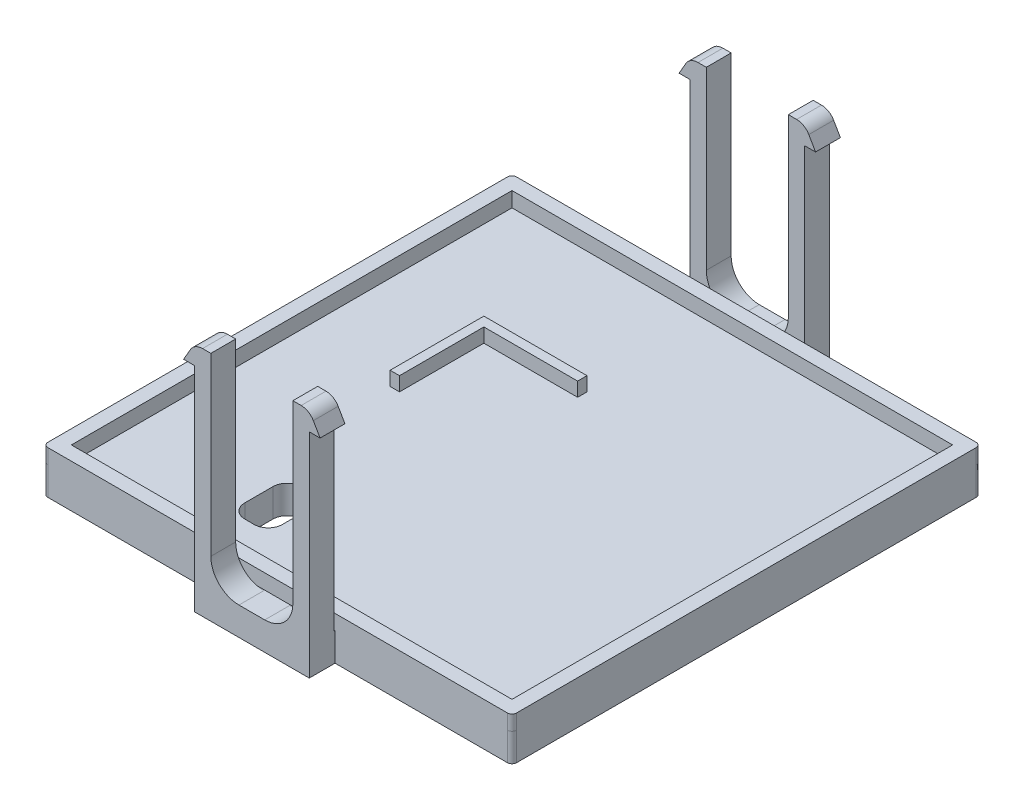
ISO-10303-21;
HEADER;
FILE_DESCRIPTION(('STEP AP214'),'2;1');
FILE_NAME('part.step','',(''),(''),'','','');
FILE_SCHEMA(('AUTOMOTIVE_DESIGN { 1 0 10303 214 1 1 1 1 }'));
ENDSEC;
DATA;
#1=APPLICATION_CONTEXT('core data for automotive mechanical design processes');
#2=APPLICATION_PROTOCOL_DEFINITION('international standard','automotive_design',2000,#1);
#3=PRODUCT_CONTEXT('',#1,'mechanical');
#4=PRODUCT('Part','Part','',(#3));
#5=PRODUCT_RELATED_PRODUCT_CATEGORY('part','',(#4));
#6=PRODUCT_DEFINITION_FORMATION('','',#4);
#7=PRODUCT_DEFINITION_CONTEXT('part definition',#1,'design');
#8=PRODUCT_DEFINITION('design','',#6,#7);
#9=PRODUCT_DEFINITION_SHAPE('','',#8);
#10=(LENGTH_UNIT() NAMED_UNIT(*) SI_UNIT(.MILLI.,.METRE.));
#11=(NAMED_UNIT(*) PLANE_ANGLE_UNIT() SI_UNIT($,.RADIAN.));
#12=(NAMED_UNIT(*) SI_UNIT($,.STERADIAN.) SOLID_ANGLE_UNIT());
#13=UNCERTAINTY_MEASURE_WITH_UNIT(LENGTH_MEASURE(1.E-05),#10,'distance_accuracy_value','');
#14=(GEOMETRIC_REPRESENTATION_CONTEXT(3) GLOBAL_UNCERTAINTY_ASSIGNED_CONTEXT((#13)) GLOBAL_UNIT_ASSIGNED_CONTEXT((#10,
#11,#12)) REPRESENTATION_CONTEXT('',''));
#15=CARTESIAN_POINT('',(0.,0.,0.));
#16=DIRECTION('',(0.,0.,1.));
#17=DIRECTION('',(1.,0.,0.));
#18=AXIS2_PLACEMENT_3D('',#15,#16,#17);
#19=CARTESIAN_POINT('',(0.,2.,0.));
#20=DIRECTION('',(0.,-1.,0.));
#21=DIRECTION('',(0.,0.,-1.));
#22=AXIS2_PLACEMENT_3D('',#19,#20,#21);
#23=PLANE('',#22);
#24=DIRECTION('',(0.,0.,-1.));
#25=VECTOR('',#24,1.);
#26=CARTESIAN_POINT('',(-13.,2.,36.));
#27=LINE('',#26,#25);
#28=CARTESIAN_POINT('',(-13.,2.,36.));
#29=VERTEX_POINT('',#28);
#30=CARTESIAN_POINT('',(-13.,2.,30.));
#31=VERTEX_POINT('',#30);
#32=EDGE_CURVE('E536',#29,#31,#27,.T.);
#33=ORIENTED_EDGE('',*,*,#32,.F.);
#34=CARTESIAN_POINT('',(-16.,2.,36.));
#35=DIRECTION('',(0.,1.,0.));
#36=DIRECTION('',(0.,0.,1.));
#37=AXIS2_PLACEMENT_3D('',#34,#35,#36);
#38=CIRCLE('',#37,3.);
#39=CARTESIAN_POINT('',(-16.,2.,39.));
#40=VERTEX_POINT('',#39);
#41=EDGE_CURVE('E48',#40,#29,#38,.T.);
#42=ORIENTED_EDGE('',*,*,#41,.F.);
#43=DIRECTION('',(1.,0.,0.));
#44=VECTOR('',#43,1.);
#45=CARTESIAN_POINT('',(-18.,2.,39.));
#46=LINE('',#45,#44);
#47=CARTESIAN_POINT('',(-18.,2.,39.));
#48=VERTEX_POINT('',#47);
#49=EDGE_CURVE('E551',#48,#40,#46,.T.);
#50=ORIENTED_EDGE('',*,*,#49,.F.);
#51=CARTESIAN_POINT('',(-18.,2.,36.));
#52=DIRECTION('',(0.,1.,0.));
#53=DIRECTION('',(0.,0.,-1.));
#54=AXIS2_PLACEMENT_3D('',#51,#52,#53);
#55=CIRCLE('',#54,3.);
#56=CARTESIAN_POINT('',(-21.,2.,36.));
#57=VERTEX_POINT('',#56);
#58=EDGE_CURVE('E549',#57,#48,#55,.T.);
#59=ORIENTED_EDGE('',*,*,#58,.F.);
#60=DIRECTION('',(0.,0.,1.));
#61=VECTOR('',#60,1.);
#62=CARTESIAN_POINT('',(-21.,2.,36.));
#63=LINE('',#62,#61);
#64=CARTESIAN_POINT('',(-21.,2.,30.));
#65=VERTEX_POINT('',#64);
#66=EDGE_CURVE('E452',#65,#57,#63,.T.);
#67=ORIENTED_EDGE('',*,*,#66,.F.);
#68=CARTESIAN_POINT('',(-18.,2.,30.));
#69=DIRECTION('',(0.,1.,0.));
#70=DIRECTION('',(0.,0.,-1.));
#71=AXIS2_PLACEMENT_3D('',#68,#69,#70);
#72=CIRCLE('',#71,3.);
#73=CARTESIAN_POINT('',(-18.,2.,27.));
#74=VERTEX_POINT('',#73);
#75=EDGE_CURVE('E545',#74,#65,#72,.T.);
#76=ORIENTED_EDGE('',*,*,#75,.F.);
#77=DIRECTION('',(-1.,0.,0.));
#78=VECTOR('',#77,1.);
#79=CARTESIAN_POINT('',(-18.,2.,27.));
#80=LINE('',#79,#78);
#81=CARTESIAN_POINT('',(-16.,2.,27.));
#82=VERTEX_POINT('',#81);
#83=EDGE_CURVE('E542',#82,#74,#80,.T.);
#84=ORIENTED_EDGE('',*,*,#83,.F.);
#85=CARTESIAN_POINT('',(-16.,2.,30.));
#86=DIRECTION('',(0.,1.,0.));
#87=DIRECTION('',(0.,0.,-1.));
#88=AXIS2_PLACEMENT_3D('',#85,#86,#87);
#89=CIRCLE('',#88,3.);
#90=EDGE_CURVE('E539',#31,#82,#89,.T.);
#91=ORIENTED_EDGE('',*,*,#90,.F.);
#92=EDGE_LOOP('',(#33,#42,#50,#59,#67,#76,#84,#91));
#93=FACE_BOUND('',#92,.T.);
#94=DIRECTION('',(1.,0.,0.));
#95=VECTOR('',#94,1.);
#96=CARTESIAN_POINT('',(-47.,2.,47.));
#97=LINE('',#96,#95);
#98=CARTESIAN_POINT('',(-47.,2.,47.));
#99=VERTEX_POINT('',#98);
#100=CARTESIAN_POINT('',(47.,2.,47.));
#101=VERTEX_POINT('',#100);
#102=EDGE_CURVE('E616',#99,#101,#97,.T.);
#103=ORIENTED_EDGE('',*,*,#102,.T.);
#104=DIRECTION('',(0.,0.,-1.));
#105=VECTOR('',#104,1.);
#106=CARTESIAN_POINT('',(47.,2.,-47.));
#107=LINE('',#106,#105);
#108=CARTESIAN_POINT('',(47.,2.,-47.));
#109=VERTEX_POINT('',#108);
#110=EDGE_CURVE('E612',#101,#109,#107,.T.);
#111=ORIENTED_EDGE('',*,*,#110,.T.);
#112=DIRECTION('',(-1.,0.,0.));
#113=VECTOR('',#112,1.);
#114=CARTESIAN_POINT('',(-47.,2.,-47.));
#115=LINE('',#114,#113);
#116=CARTESIAN_POINT('',(-47.,2.,-47.));
#117=VERTEX_POINT('',#116);
#118=EDGE_CURVE('E626',#109,#117,#115,.T.);
#119=ORIENTED_EDGE('',*,*,#118,.T.);
#120=DIRECTION('',(0.,0.,1.));
#121=VECTOR('',#120,1.);
#122=CARTESIAN_POINT('',(-47.,2.,-47.));
#123=LINE('',#122,#121);
#124=EDGE_CURVE('E629',#117,#99,#123,.T.);
#125=ORIENTED_EDGE('',*,*,#124,.T.);
#126=EDGE_LOOP('',(#103,#111,#119,#125));
#127=FACE_BOUND('',#126,.T.);
#128=DIRECTION('',(1.,0.,0.));
#129=VECTOR('',#128,1.);
#130=CARTESIAN_POINT('',(-25.,2.,-1.00000000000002));
#131=LINE('',#130,#129);
#132=CARTESIAN_POINT('',(-27.,2.,-1.00000000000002));
#133=VERTEX_POINT('',#132);
#134=CARTESIAN_POINT('',(-25.,2.,-1.00000000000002));
#135=VERTEX_POINT('',#134);
#136=EDGE_CURVE('E557',#133,#135,#131,.T.);
#137=ORIENTED_EDGE('',*,*,#136,.F.);
#138=DIRECTION('',(0.,0.,1.));
#139=VECTOR('',#138,1.);
#140=CARTESIAN_POINT('',(-27.,2.,-1.00000000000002));
#141=LINE('',#140,#139);
#142=CARTESIAN_POINT('',(-27.,2.,-21.));
#143=VERTEX_POINT('',#142);
#144=EDGE_CURVE('E571',#143,#133,#141,.T.);
#145=ORIENTED_EDGE('',*,*,#144,.F.);
#146=DIRECTION('',(-1.,0.,0.));
#147=VECTOR('',#146,1.);
#148=CARTESIAN_POINT('',(-27.,2.,-21.));
#149=LINE('',#148,#147);
#150=CARTESIAN_POINT('',(-5.,2.,-21.));
#151=VERTEX_POINT('',#150);
#152=EDGE_CURVE('E591',#151,#143,#149,.T.);
#153=ORIENTED_EDGE('',*,*,#152,.F.);
#154=DIRECTION('',(0.,0.,-1.));
#155=VECTOR('',#154,1.);
#156=CARTESIAN_POINT('',(-5.,2.,-21.));
#157=LINE('',#156,#155);
#158=CARTESIAN_POINT('',(-5.,2.,-19.));
#159=VERTEX_POINT('',#158);
#160=EDGE_CURVE('E588',#159,#151,#157,.T.);
#161=ORIENTED_EDGE('',*,*,#160,.F.);
#162=DIRECTION('',(1.,0.,0.));
#163=VECTOR('',#162,1.);
#164=CARTESIAN_POINT('',(-5.,2.,-19.));
#165=LINE('',#164,#163);
#166=CARTESIAN_POINT('',(-25.,2.,-19.));
#167=VERTEX_POINT('',#166);
#168=EDGE_CURVE('E585',#167,#159,#165,.T.);
#169=ORIENTED_EDGE('',*,*,#168,.F.);
#170=DIRECTION('',(0.,0.,-1.));
#171=VECTOR('',#170,1.);
#172=CARTESIAN_POINT('',(-25.,2.,-19.));
#173=LINE('',#172,#171);
#174=EDGE_CURVE('E56',#135,#167,#173,.T.);
#175=ORIENTED_EDGE('',*,*,#174,.F.);
#176=EDGE_LOOP('',(#137,#145,#153,#161,#169,#175));
#177=FACE_BOUND('',#176,.T.);
#178=ADVANCED_FACE('F33',(#93,#127,#177),#23,.F.);
#179=CARTESIAN_POINT('',(0.,5.2,0.));
#180=DIRECTION('',(0.,-1.,0.));
#181=DIRECTION('',(0.,0.,-1.));
#182=AXIS2_PLACEMENT_3D('',#179,#180,#181);
#183=PLANE('',#182);
#184=DIRECTION('',(-1.,0.,0.));
#185=VECTOR('',#184,1.);
#186=CARTESIAN_POINT('',(-50.,5.2,-50.0000000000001));
#187=LINE('',#186,#185);
#188=CARTESIAN_POINT('',(49.,5.2,-50.0000000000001));
#189=VERTEX_POINT('',#188);
#190=CARTESIAN_POINT('',(-49.,5.2,-50.0000000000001));
#191=VERTEX_POINT('',#190);
#192=EDGE_CURVE('E646',#189,#191,#187,.T.);
#193=ORIENTED_EDGE('',*,*,#192,.T.);
#194=CARTESIAN_POINT('',(-49.,5.2,-49.));
#195=DIRECTION('',(0.,-1.,0.));
#196=DIRECTION('',(0.,0.,-1.));
#197=AXIS2_PLACEMENT_3D('',#194,#195,#196);
#198=CIRCLE('',#197,1.);
#199=CARTESIAN_POINT('',(-50.,5.2,-49.));
#200=VERTEX_POINT('',#199);
#201=EDGE_CURVE('E948',#191,#200,#198,.F.);
#202=ORIENTED_EDGE('',*,*,#201,.T.);
#203=DIRECTION('',(0.,0.,1.));
#204=VECTOR('',#203,1.);
#205=CARTESIAN_POINT('',(-50.,5.2,50.));
#206=LINE('',#205,#204);
#207=CARTESIAN_POINT('',(-50.,5.2,49.));
#208=VERTEX_POINT('',#207);
#209=EDGE_CURVE('E650',#200,#208,#206,.T.);
#210=ORIENTED_EDGE('',*,*,#209,.T.);
#211=CARTESIAN_POINT('',(-49.,5.2,49.));
#212=DIRECTION('',(0.,-1.,0.));
#213=DIRECTION('',(0.,0.,-1.));
#214=AXIS2_PLACEMENT_3D('',#211,#212,#213);
#215=CIRCLE('',#214,1.);
#216=CARTESIAN_POINT('',(-49.,5.2,50.));
#217=VERTEX_POINT('',#216);
#218=EDGE_CURVE('E942',#208,#217,#215,.F.);
#219=ORIENTED_EDGE('',*,*,#218,.T.);
#220=DIRECTION('',(1.,0.,0.));
#221=VECTOR('',#220,1.);
#222=CARTESIAN_POINT('',(-50.,5.2,50.));
#223=LINE('',#222,#221);
#224=CARTESIAN_POINT('',(49.,5.2,50.));
#225=VERTEX_POINT('',#224);
#226=EDGE_CURVE('E653',#217,#225,#223,.T.);
#227=ORIENTED_EDGE('',*,*,#226,.T.);
#228=CARTESIAN_POINT('',(49.,5.2,49.));
#229=DIRECTION('',(0.,-1.,0.));
#230=DIRECTION('',(0.,0.,-1.));
#231=AXIS2_PLACEMENT_3D('',#228,#229,#230);
#232=CIRCLE('',#231,1.);
#233=CARTESIAN_POINT('',(50.,5.2,49.));
#234=VERTEX_POINT('',#233);
#235=EDGE_CURVE('E944',#225,#234,#232,.F.);
#236=ORIENTED_EDGE('',*,*,#235,.T.);
#237=DIRECTION('',(0.,0.,-1.));
#238=VECTOR('',#237,1.);
#239=CARTESIAN_POINT('',(50.,5.2,50.));
#240=LINE('',#239,#238);
#241=CARTESIAN_POINT('',(50.,5.2,-49.));
#242=VERTEX_POINT('',#241);
#243=EDGE_CURVE('E643',#234,#242,#240,.T.);
#244=ORIENTED_EDGE('',*,*,#243,.T.);
#245=CARTESIAN_POINT('',(49.,5.2,-49.));
#246=DIRECTION('',(0.,-1.,0.));
#247=DIRECTION('',(0.,0.,-1.));
#248=AXIS2_PLACEMENT_3D('',#245,#246,#247);
#249=CIRCLE('',#248,1.);
#250=EDGE_CURVE('E946',#242,#189,#249,.F.);
#251=ORIENTED_EDGE('',*,*,#250,.T.);
#252=EDGE_LOOP('',(#193,#202,#210,#219,#227,#236,#244,#251));
#253=FACE_BOUND('',#252,.T.);
#254=DIRECTION('',(0.,0.,-1.));
#255=VECTOR('',#254,1.);
#256=CARTESIAN_POINT('',(47.,5.2,-47.));
#257=LINE('',#256,#255);
#258=CARTESIAN_POINT('',(47.,5.2,47.));
#259=VERTEX_POINT('',#258);
#260=CARTESIAN_POINT('',(47.,5.2,-47.));
#261=VERTEX_POINT('',#260);
#262=EDGE_CURVE('E613',#259,#261,#257,.T.);
#263=ORIENTED_EDGE('',*,*,#262,.F.);
#264=DIRECTION('',(1.,0.,0.));
#265=VECTOR('',#264,1.);
#266=CARTESIAN_POINT('',(-47.,5.2,47.));
#267=LINE('',#266,#265);
#268=CARTESIAN_POINT('',(-47.,5.2,47.));
#269=VERTEX_POINT('',#268);
#270=EDGE_CURVE('E621',#269,#259,#267,.T.);
#271=ORIENTED_EDGE('',*,*,#270,.F.);
#272=DIRECTION('',(0.,0.,1.));
#273=VECTOR('',#272,1.);
#274=CARTESIAN_POINT('',(-47.,5.2,-47.));
#275=LINE('',#274,#273);
#276=CARTESIAN_POINT('',(-47.,5.2,-47.));
#277=VERTEX_POINT('',#276);
#278=EDGE_CURVE('E618',#277,#269,#275,.T.);
#279=ORIENTED_EDGE('',*,*,#278,.F.);
#280=DIRECTION('',(-1.,0.,0.));
#281=VECTOR('',#280,1.);
#282=CARTESIAN_POINT('',(-47.,5.2,-47.));
#283=LINE('',#282,#281);
#284=EDGE_CURVE('E615',#261,#277,#283,.T.);
#285=ORIENTED_EDGE('',*,*,#284,.F.);
#286=EDGE_LOOP('',(#263,#271,#279,#285));
#287=FACE_BOUND('',#286,.T.);
#288=ADVANCED_FACE('F996',(#253,#287),#183,.F.);
#289=CARTESIAN_POINT('',(47.,5.2,-47.));
#290=DIRECTION('',(-1.,0.,0.));
#291=DIRECTION('',(0.,0.,1.));
#292=AXIS2_PLACEMENT_3D('',#289,#290,#291);
#293=PLANE('',#292);
#294=ORIENTED_EDGE('',*,*,#110,.F.);
#295=DIRECTION('',(0.,-1.,0.));
#296=VECTOR('',#295,1.);
#297=CARTESIAN_POINT('',(47.,5.2,47.));
#298=LINE('',#297,#296);
#299=EDGE_CURVE('E623',#259,#101,#298,.T.);
#300=ORIENTED_EDGE('',*,*,#299,.F.);
#301=ORIENTED_EDGE('',*,*,#262,.T.);
#302=DIRECTION('',(0.,-1.,0.));
#303=VECTOR('',#302,1.);
#304=CARTESIAN_POINT('',(47.,5.2,-47.));
#305=LINE('',#304,#303);
#306=EDGE_CURVE('E639',#261,#109,#305,.T.);
#307=ORIENTED_EDGE('',*,*,#306,.T.);
#308=EDGE_LOOP('',(#294,#300,#301,#307));
#309=FACE_BOUND('',#308,.T.);
#310=ADVANCED_FACE('F1100',(#309),#293,.T.);
#311=CARTESIAN_POINT('',(-47.,5.2,-47.));
#312=DIRECTION('',(0.,0.,1.));
#313=DIRECTION('',(1.,0.,0.));
#314=AXIS2_PLACEMENT_3D('',#311,#312,#313);
#315=PLANE('',#314);
#316=ORIENTED_EDGE('',*,*,#118,.F.);
#317=ORIENTED_EDGE('',*,*,#306,.F.);
#318=ORIENTED_EDGE('',*,*,#284,.T.);
#319=DIRECTION('',(0.,-1.,0.));
#320=VECTOR('',#319,1.);
#321=CARTESIAN_POINT('',(-47.,5.2,-47.));
#322=LINE('',#321,#320);
#323=EDGE_CURVE('E637',#277,#117,#322,.T.);
#324=ORIENTED_EDGE('',*,*,#323,.T.);
#325=EDGE_LOOP('',(#316,#317,#318,#324));
#326=FACE_BOUND('',#325,.T.);
#327=ADVANCED_FACE('F1213',(#326),#315,.T.);
#328=CARTESIAN_POINT('',(-47.,5.2,-47.));
#329=DIRECTION('',(1.,0.,0.));
#330=DIRECTION('',(0.,0.,-1.));
#331=AXIS2_PLACEMENT_3D('',#328,#329,#330);
#332=PLANE('',#331);
#333=ORIENTED_EDGE('',*,*,#124,.F.);
#334=ORIENTED_EDGE('',*,*,#323,.F.);
#335=ORIENTED_EDGE('',*,*,#278,.T.);
#336=DIRECTION('',(0.,-1.,0.));
#337=VECTOR('',#336,1.);
#338=CARTESIAN_POINT('',(-47.,5.2,47.));
#339=LINE('',#338,#337);
#340=EDGE_CURVE('E635',#269,#99,#339,.T.);
#341=ORIENTED_EDGE('',*,*,#340,.T.);
#342=EDGE_LOOP('',(#333,#334,#335,#341));
#343=FACE_BOUND('',#342,.T.);
#344=ADVANCED_FACE('F1217',(#343),#332,.T.);
#345=CARTESIAN_POINT('',(-47.,5.2,47.));
#346=DIRECTION('',(0.,0.,-1.));
#347=DIRECTION('',(-1.,0.,0.));
#348=AXIS2_PLACEMENT_3D('',#345,#346,#347);
#349=PLANE('',#348);
#350=ORIENTED_EDGE('',*,*,#102,.F.);
#351=ORIENTED_EDGE('',*,*,#340,.F.);
#352=ORIENTED_EDGE('',*,*,#270,.T.);
#353=ORIENTED_EDGE('',*,*,#299,.T.);
#354=EDGE_LOOP('',(#350,#351,#352,#353));
#355=FACE_BOUND('',#354,.T.);
#356=ADVANCED_FACE('F1146',(#355),#349,.T.);
#357=CARTESIAN_POINT('',(-8.75000000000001,45.5,-50.2));
#358=DIRECTION('',(1.,0.,0.));
#359=DIRECTION('',(0.,1.,0.));
#360=AXIS2_PLACEMENT_3D('',#357,#358,#359);
#361=PLANE('',#360);
#362=DIRECTION('',(0.,-1.,0.));
#363=VECTOR('',#362,1.);
#364=CARTESIAN_POINT('',(-8.75000000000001,45.5,-50.2));
#365=LINE('',#364,#363);
#366=CARTESIAN_POINT('',(-8.75000000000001,45.5,-50.2));
#367=VERTEX_POINT('',#366);
#368=CARTESIAN_POINT('',(-8.75,8.,-50.2));
#369=VERTEX_POINT('',#368);
#370=EDGE_CURVE('E761',#367,#369,#365,.T.);
#371=ORIENTED_EDGE('',*,*,#370,.T.);
#372=DIRECTION('',(0.,0.,-1.));
#373=VECTOR('',#372,1.);
#374=CARTESIAN_POINT('',(-8.75,8.,-50.2));
#375=LINE('',#374,#373);
#376=CARTESIAN_POINT('',(-8.75,8.,-55.5));
#377=VERTEX_POINT('',#376);
#378=EDGE_CURVE('E892',#369,#377,#375,.T.);
#379=ORIENTED_EDGE('',*,*,#378,.T.);
#380=DIRECTION('',(0.,-1.,0.));
#381=VECTOR('',#380,1.);
#382=CARTESIAN_POINT('',(-8.75000000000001,45.5,-55.5));
#383=LINE('',#382,#381);
#384=CARTESIAN_POINT('',(-8.75000000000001,45.5,-55.5));
#385=VERTEX_POINT('',#384);
#386=EDGE_CURVE('E755',#385,#377,#383,.T.);
#387=ORIENTED_EDGE('',*,*,#386,.F.);
#388=DIRECTION('',(0.,0.,-1.));
#389=VECTOR('',#388,1.);
#390=CARTESIAN_POINT('',(-8.75000000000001,45.5,-50.2));
#391=LINE('',#390,#389);
#392=EDGE_CURVE('E796',#367,#385,#391,.T.);
#393=ORIENTED_EDGE('',*,*,#392,.F.);
#394=EDGE_LOOP('',(#371,#379,#387,#393));
#395=FACE_BOUND('',#394,.T.);
#396=ADVANCED_FACE('F1046',(#395),#361,.T.);
#397=CARTESIAN_POINT('',(-10.5179491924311,45.5,-50.2));
#398=DIRECTION('',(0.,1.,0.));
#399=DIRECTION('',(-1.,0.,0.));
#400=AXIS2_PLACEMENT_3D('',#397,#398,#399);
#401=PLANE('',#400);
#402=DIRECTION('',(1.,0.,0.));
#403=VECTOR('',#402,1.);
#404=CARTESIAN_POINT('',(-10.5179491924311,45.5,-55.5));
#405=LINE('',#404,#403);
#406=CARTESIAN_POINT('',(-10.5179491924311,45.5,-55.5));
#407=VERTEX_POINT('',#406);
#408=EDGE_CURVE('E765',#407,#385,#405,.T.);
#409=ORIENTED_EDGE('',*,*,#408,.F.);
#410=DIRECTION('',(0.,0.,-1.));
#411=VECTOR('',#410,1.);
#412=CARTESIAN_POINT('',(-10.5179491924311,45.5,-50.2));
#413=LINE('',#412,#411);
#414=CARTESIAN_POINT('',(-10.5179491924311,45.5,-50.2));
#415=VERTEX_POINT('',#414);
#416=EDGE_CURVE('E799',#415,#407,#413,.T.);
#417=ORIENTED_EDGE('',*,*,#416,.F.);
#418=DIRECTION('',(1.,0.,0.));
#419=VECTOR('',#418,1.);
#420=CARTESIAN_POINT('',(-10.5179491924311,45.5,-50.2));
#421=LINE('',#420,#419);
#422=EDGE_CURVE('E779',#415,#367,#421,.T.);
#423=ORIENTED_EDGE('',*,*,#422,.T.);
#424=ORIENTED_EDGE('',*,*,#392,.T.);
#425=EDGE_LOOP('',(#409,#417,#423,#424));
#426=FACE_BOUND('',#425,.T.);
#427=ADVANCED_FACE('F1054',(#426),#401,.T.);
#428=CARTESIAN_POINT('',(-10.5179491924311,42.5,-50.2));
#429=DIRECTION('',(0.,0.,-1.));
#430=DIRECTION('',(-1.,0.,0.));
#431=AXIS2_PLACEMENT_3D('',#428,#429,#430);
#432=CYLINDRICAL_SURFACE('',#431,3.00000000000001);
#433=CARTESIAN_POINT('',(-10.5179491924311,42.5,-55.5));
#434=DIRECTION('',(0.,0.,-1.));
#435=DIRECTION('',(1.,0.,0.));
#436=AXIS2_PLACEMENT_3D('',#433,#434,#435);
#437=CIRCLE('',#436,3.00000000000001);
#438=CARTESIAN_POINT('',(-13.1160254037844,44.,-55.5));
#439=VERTEX_POINT('',#438);
#440=EDGE_CURVE('E791',#439,#407,#437,.T.);
#441=ORIENTED_EDGE('',*,*,#440,.F.);
#442=DIRECTION('',(0.,0.,-1.));
#443=VECTOR('',#442,1.);
#444=CARTESIAN_POINT('',(-13.1160254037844,44.,-50.2));
#445=LINE('',#444,#443);
#446=CARTESIAN_POINT('',(-13.1160254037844,44.,-50.2));
#447=VERTEX_POINT('',#446);
#448=EDGE_CURVE('E801',#447,#439,#445,.T.);
#449=ORIENTED_EDGE('',*,*,#448,.F.);
#450=CARTESIAN_POINT('',(-10.5179491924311,42.5,-50.2));
#451=DIRECTION('',(0.,0.,-1.));
#452=DIRECTION('',(1.,0.,0.));
#453=AXIS2_PLACEMENT_3D('',#450,#451,#452);
#454=CIRCLE('',#453,3.00000000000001);
#455=EDGE_CURVE('E776',#447,#415,#454,.T.);
#456=ORIENTED_EDGE('',*,*,#455,.T.);
#457=ORIENTED_EDGE('',*,*,#416,.T.);
#458=EDGE_LOOP('',(#441,#449,#456,#457));
#459=FACE_BOUND('',#458,.T.);
#460=ADVANCED_FACE('F1057',(#459),#432,.T.);
#461=CARTESIAN_POINT('',(-14.5594010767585,41.5,-50.2));
#462=DIRECTION('',(-0.866025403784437,0.500000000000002,0.));
#463=DIRECTION('',(-0.500000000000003,-0.866025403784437,0.));
#464=AXIS2_PLACEMENT_3D('',#461,#462,#463);
#465=PLANE('',#464);
#466=DIRECTION('',(0.500000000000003,0.866025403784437,0.));
#467=VECTOR('',#466,1.);
#468=CARTESIAN_POINT('',(-14.5594010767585,41.5,-55.5));
#469=LINE('',#468,#467);
#470=CARTESIAN_POINT('',(-14.5594010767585,41.5,-55.5));
#471=VERTEX_POINT('',#470);
#472=EDGE_CURVE('E788',#471,#439,#469,.T.);
#473=ORIENTED_EDGE('',*,*,#472,.F.);
#474=DIRECTION('',(0.,0.,-1.));
#475=VECTOR('',#474,1.);
#476=CARTESIAN_POINT('',(-14.5594010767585,41.5,-50.2));
#477=LINE('',#476,#475);
#478=CARTESIAN_POINT('',(-14.5594010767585,41.5,-50.2));
#479=VERTEX_POINT('',#478);
#480=EDGE_CURVE('E803',#479,#471,#477,.T.);
#481=ORIENTED_EDGE('',*,*,#480,.F.);
#482=DIRECTION('',(0.500000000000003,0.866025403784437,0.));
#483=VECTOR('',#482,1.);
#484=CARTESIAN_POINT('',(-14.5594010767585,41.5,-50.2));
#485=LINE('',#484,#483);
#486=EDGE_CURVE('E773',#479,#447,#485,.T.);
#487=ORIENTED_EDGE('',*,*,#486,.T.);
#488=ORIENTED_EDGE('',*,*,#448,.T.);
#489=EDGE_LOOP('',(#473,#481,#487,#488));
#490=FACE_BOUND('',#489,.T.);
#491=ADVANCED_FACE('F1062',(#490),#465,.T.);
#492=CARTESIAN_POINT('',(8.75000000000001,45.5,-50.2));
#493=DIRECTION('',(-1.,0.,0.));
#494=DIRECTION('',(0.,-1.,0.));
#495=AXIS2_PLACEMENT_3D('',#492,#493,#494);
#496=PLANE('',#495);
#497=DIRECTION('',(0.,1.,0.));
#498=VECTOR('',#497,1.);
#499=CARTESIAN_POINT('',(8.75000000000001,45.5,-55.5));
#500=LINE('',#499,#498);
#501=CARTESIAN_POINT('',(8.75,8.,-55.5));
#502=VERTEX_POINT('',#501);
#503=CARTESIAN_POINT('',(8.75000000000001,45.5,-55.5));
#504=VERTEX_POINT('',#503);
#505=EDGE_CURVE('E798',#502,#504,#500,.T.);
#506=ORIENTED_EDGE('',*,*,#505,.F.);
#507=DIRECTION('',(0.,0.,-1.));
#508=VECTOR('',#507,1.);
#509=CARTESIAN_POINT('',(8.75,8.,-50.2));
#510=LINE('',#509,#508);
#511=CARTESIAN_POINT('',(8.75,8.,-50.2));
#512=VERTEX_POINT('',#511);
#513=EDGE_CURVE('E901',#502,#512,#510,.F.);
#514=ORIENTED_EDGE('',*,*,#513,.T.);
#515=DIRECTION('',(0.,1.,0.));
#516=VECTOR('',#515,1.);
#517=CARTESIAN_POINT('',(8.75000000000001,45.5,-50.2));
#518=LINE('',#517,#516);
#519=CARTESIAN_POINT('',(8.75000000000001,45.5,-50.2));
#520=VERTEX_POINT('',#519);
#521=EDGE_CURVE('E809',#512,#520,#518,.T.);
#522=ORIENTED_EDGE('',*,*,#521,.T.);
#523=DIRECTION('',(0.,0.,-1.));
#524=VECTOR('',#523,1.);
#525=CARTESIAN_POINT('',(8.75000000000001,45.5,-50.2));
#526=LINE('',#525,#524);
#527=EDGE_CURVE('E827',#520,#504,#526,.T.);
#528=ORIENTED_EDGE('',*,*,#527,.T.);
#529=EDGE_LOOP('',(#506,#514,#522,#528));
#530=FACE_BOUND('',#529,.T.);
#531=ADVANCED_FACE('F1120',(#530),#496,.T.);
#532=CARTESIAN_POINT('',(10.5179491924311,45.5,-50.2));
#533=DIRECTION('',(0.,1.,0.));
#534=DIRECTION('',(-1.,0.,0.));
#535=AXIS2_PLACEMENT_3D('',#532,#533,#534);
#536=PLANE('',#535);
#537=DIRECTION('',(1.,0.,0.));
#538=VECTOR('',#537,1.);
#539=CARTESIAN_POINT('',(10.5179491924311,45.5,-55.5));
#540=LINE('',#539,#538);
#541=CARTESIAN_POINT('',(10.5179491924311,45.5,-55.5));
#542=VERTEX_POINT('',#541);
#543=EDGE_CURVE('E829',#504,#542,#540,.T.);
#544=ORIENTED_EDGE('',*,*,#543,.F.);
#545=ORIENTED_EDGE('',*,*,#527,.F.);
#546=DIRECTION('',(1.,0.,0.));
#547=VECTOR('',#546,1.);
#548=CARTESIAN_POINT('',(10.5179491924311,45.5,-50.2));
#549=LINE('',#548,#547);
#550=CARTESIAN_POINT('',(10.5179491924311,45.5,-50.2));
#551=VERTEX_POINT('',#550);
#552=EDGE_CURVE('E812',#520,#551,#549,.T.);
#553=ORIENTED_EDGE('',*,*,#552,.T.);
#554=DIRECTION('',(0.,0.,-1.));
#555=VECTOR('',#554,1.);
#556=CARTESIAN_POINT('',(10.5179491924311,45.5,-50.2));
#557=LINE('',#556,#555);
#558=EDGE_CURVE('E848',#551,#542,#557,.T.);
#559=ORIENTED_EDGE('',*,*,#558,.T.);
#560=EDGE_LOOP('',(#544,#545,#553,#559));
#561=FACE_BOUND('',#560,.T.);
#562=ADVANCED_FACE('F1123',(#561),#536,.T.);
#563=CARTESIAN_POINT('',(10.5179491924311,42.5,-50.2));
#564=DIRECTION('',(0.,0.,-1.));
#565=DIRECTION('',(-1.,0.,0.));
#566=AXIS2_PLACEMENT_3D('',#563,#564,#565);
#567=CYLINDRICAL_SURFACE('',#566,3.00000000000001);
#568=CARTESIAN_POINT('',(10.5179491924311,42.5,-55.5));
#569=DIRECTION('',(0.,0.,-1.));
#570=DIRECTION('',(1.,0.,0.));
#571=AXIS2_PLACEMENT_3D('',#568,#569,#570);
#572=CIRCLE('',#571,3.00000000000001);
#573=CARTESIAN_POINT('',(13.1160254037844,44.,-55.5));
#574=VERTEX_POINT('',#573);
#575=EDGE_CURVE('E832',#542,#574,#572,.T.);
#576=ORIENTED_EDGE('',*,*,#575,.F.);
#577=ORIENTED_EDGE('',*,*,#558,.F.);
#578=CARTESIAN_POINT('',(10.5179491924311,42.5,-50.2));
#579=DIRECTION('',(0.,0.,-1.));
#580=DIRECTION('',(1.,0.,0.));
#581=AXIS2_PLACEMENT_3D('',#578,#579,#580);
#582=CIRCLE('',#581,3.00000000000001);
#583=CARTESIAN_POINT('',(13.1160254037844,44.,-50.2));
#584=VERTEX_POINT('',#583);
#585=EDGE_CURVE('E815',#551,#584,#582,.T.);
#586=ORIENTED_EDGE('',*,*,#585,.T.);
#587=DIRECTION('',(0.,0.,-1.));
#588=VECTOR('',#587,1.);
#589=CARTESIAN_POINT('',(13.1160254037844,44.,-50.2));
#590=LINE('',#589,#588);
#591=EDGE_CURVE('E846',#584,#574,#590,.T.);
#592=ORIENTED_EDGE('',*,*,#591,.T.);
#593=EDGE_LOOP('',(#576,#577,#586,#592));
#594=FACE_BOUND('',#593,.T.);
#595=ADVANCED_FACE('F1127',(#594),#567,.T.);
#596=CARTESIAN_POINT('',(14.5594010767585,41.5,-50.2));
#597=DIRECTION('',(0.866025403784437,0.500000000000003,0.));
#598=DIRECTION('',(-0.500000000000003,0.866025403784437,0.));
#599=AXIS2_PLACEMENT_3D('',#596,#597,#598);
#600=PLANE('',#599);
#601=DIRECTION('',(0.500000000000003,-0.866025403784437,0.));
#602=VECTOR('',#601,1.);
#603=CARTESIAN_POINT('',(14.5594010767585,41.5,-55.5));
#604=LINE('',#603,#602);
#605=CARTESIAN_POINT('',(14.5594010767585,41.5,-55.5));
#606=VERTEX_POINT('',#605);
#607=EDGE_CURVE('E835',#574,#606,#604,.T.);
#608=ORIENTED_EDGE('',*,*,#607,.F.);
#609=ORIENTED_EDGE('',*,*,#591,.F.);
#610=DIRECTION('',(0.500000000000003,-0.866025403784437,0.));
#611=VECTOR('',#610,1.);
#612=CARTESIAN_POINT('',(14.5594010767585,41.5,-50.2));
#613=LINE('',#612,#611);
#614=CARTESIAN_POINT('',(14.5594010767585,41.5,-50.2));
#615=VERTEX_POINT('',#614);
#616=EDGE_CURVE('E818',#584,#615,#613,.T.);
#617=ORIENTED_EDGE('',*,*,#616,.T.);
#618=DIRECTION('',(0.,0.,-1.));
#619=VECTOR('',#618,1.);
#620=CARTESIAN_POINT('',(14.5594010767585,41.5,-50.2));
#621=LINE('',#620,#619);
#622=EDGE_CURVE('E844',#615,#606,#621,.T.);
#623=ORIENTED_EDGE('',*,*,#622,.T.);
#624=EDGE_LOOP('',(#608,#609,#617,#623));
#625=FACE_BOUND('',#624,.T.);
#626=ADVANCED_FACE('F1131',(#625),#600,.T.);
#627=CARTESIAN_POINT('',(8.75000000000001,45.5,50.2));
#628=DIRECTION('',(1.,0.,0.));
#629=DIRECTION('',(0.,1.,0.));
#630=AXIS2_PLACEMENT_3D('',#627,#628,#629);
#631=PLANE('',#630);
#632=DIRECTION('',(0.,1.,0.));
#633=VECTOR('',#632,1.);
#634=CARTESIAN_POINT('',(8.75000000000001,45.5,50.2));
#635=LINE('',#634,#633);
#636=CARTESIAN_POINT('',(8.75,8.,50.2));
#637=VERTEX_POINT('',#636);
#638=CARTESIAN_POINT('',(8.75000000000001,45.5,50.2));
#639=VERTEX_POINT('',#638);
#640=EDGE_CURVE('E716',#637,#639,#635,.T.);
#641=ORIENTED_EDGE('',*,*,#640,.F.);
#642=DIRECTION('',(0.,0.,1.));
#643=VECTOR('',#642,1.);
#644=CARTESIAN_POINT('',(8.75,8.,55.5));
#645=LINE('',#644,#643);
#646=CARTESIAN_POINT('',(8.75,8.,55.5));
#647=VERTEX_POINT('',#646);
#648=EDGE_CURVE('E920',#637,#647,#645,.T.);
#649=ORIENTED_EDGE('',*,*,#648,.T.);
#650=DIRECTION('',(0.,1.,0.));
#651=VECTOR('',#650,1.);
#652=CARTESIAN_POINT('',(8.75000000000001,45.5,55.5));
#653=LINE('',#652,#651);
#654=CARTESIAN_POINT('',(8.75000000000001,45.5,55.5));
#655=VERTEX_POINT('',#654);
#656=EDGE_CURVE('E706',#647,#655,#653,.T.);
#657=ORIENTED_EDGE('',*,*,#656,.T.);
#658=DIRECTION('',(0.,0.,1.));
#659=VECTOR('',#658,1.);
#660=CARTESIAN_POINT('',(8.75000000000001,45.5,50.2));
#661=LINE('',#660,#659);
#662=EDGE_CURVE('E728',#639,#655,#661,.T.);
#663=ORIENTED_EDGE('',*,*,#662,.F.);
#664=EDGE_LOOP('',(#641,#649,#657,#663));
#665=FACE_BOUND('',#664,.T.);
#666=ADVANCED_FACE('F1135',(#665),#631,.F.);
#667=CARTESIAN_POINT('',(10.5179491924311,45.5,50.2));
#668=DIRECTION('',(0.,-1.,0.));
#669=DIRECTION('',(1.,0.,0.));
#670=AXIS2_PLACEMENT_3D('',#667,#668,#669);
#671=PLANE('',#670);
#672=DIRECTION('',(1.,0.,0.));
#673=VECTOR('',#672,1.);
#674=CARTESIAN_POINT('',(10.5179491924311,45.5,55.5));
#675=LINE('',#674,#673);
#676=CARTESIAN_POINT('',(10.5179491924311,45.5,55.5));
#677=VERTEX_POINT('',#676);
#678=EDGE_CURVE('E725',#655,#677,#675,.T.);
#679=ORIENTED_EDGE('',*,*,#678,.T.);
#680=DIRECTION('',(0.,0.,1.));
#681=VECTOR('',#680,1.);
#682=CARTESIAN_POINT('',(10.5179491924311,45.5,50.2));
#683=LINE('',#682,#681);
#684=CARTESIAN_POINT('',(10.5179491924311,45.5,50.2));
#685=VERTEX_POINT('',#684);
#686=EDGE_CURVE('E732',#685,#677,#683,.T.);
#687=ORIENTED_EDGE('',*,*,#686,.F.);
#688=DIRECTION('',(1.,0.,0.));
#689=VECTOR('',#688,1.);
#690=CARTESIAN_POINT('',(10.5179491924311,45.5,50.2));
#691=LINE('',#690,#689);
#692=EDGE_CURVE('E714',#639,#685,#691,.T.);
#693=ORIENTED_EDGE('',*,*,#692,.F.);
#694=ORIENTED_EDGE('',*,*,#662,.T.);
#695=EDGE_LOOP('',(#679,#687,#693,#694));
#696=FACE_BOUND('',#695,.T.);
#697=ADVANCED_FACE('F1180',(#696),#671,.F.);
#698=CARTESIAN_POINT('',(10.5179491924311,42.5,50.2));
#699=DIRECTION('',(0.,0.,1.));
#700=DIRECTION('',(1.,0.,0.));
#701=AXIS2_PLACEMENT_3D('',#698,#699,#700);
#702=CYLINDRICAL_SURFACE('',#701,3.00000000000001);
#703=CARTESIAN_POINT('',(10.5179491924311,42.5,55.5));
#704=DIRECTION('',(0.,0.,-1.));
#705=DIRECTION('',(1.,0.,0.));
#706=AXIS2_PLACEMENT_3D('',#703,#704,#705);
#707=CIRCLE('',#706,3.00000000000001);
#708=CARTESIAN_POINT('',(13.1160254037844,44.,55.5));
#709=VERTEX_POINT('',#708);
#710=EDGE_CURVE('E723',#677,#709,#707,.T.);
#711=ORIENTED_EDGE('',*,*,#710,.T.);
#712=DIRECTION('',(0.,0.,1.));
#713=VECTOR('',#712,1.);
#714=CARTESIAN_POINT('',(13.1160254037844,44.,50.2));
#715=LINE('',#714,#713);
#716=CARTESIAN_POINT('',(13.1160254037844,44.,50.2));
#717=VERTEX_POINT('',#716);
#718=EDGE_CURVE('E735',#717,#709,#715,.T.);
#719=ORIENTED_EDGE('',*,*,#718,.F.);
#720=CARTESIAN_POINT('',(10.5179491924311,42.5,50.2));
#721=DIRECTION('',(0.,0.,-1.));
#722=DIRECTION('',(1.,0.,0.));
#723=AXIS2_PLACEMENT_3D('',#720,#721,#722);
#724=CIRCLE('',#723,3.00000000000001);
#725=EDGE_CURVE('E712',#685,#717,#724,.T.);
#726=ORIENTED_EDGE('',*,*,#725,.F.);
#727=ORIENTED_EDGE('',*,*,#686,.T.);
#728=EDGE_LOOP('',(#711,#719,#726,#727));
#729=FACE_BOUND('',#728,.T.);
#730=ADVANCED_FACE('F1176',(#729),#702,.T.);
#731=CARTESIAN_POINT('',(14.5594010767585,41.5,50.2));
#732=DIRECTION('',(-0.866025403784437,-0.500000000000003,0.));
#733=DIRECTION('',(0.500000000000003,-0.866025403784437,0.));
#734=AXIS2_PLACEMENT_3D('',#731,#732,#733);
#735=PLANE('',#734);
#736=DIRECTION('',(0.500000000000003,-0.866025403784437,0.));
#737=VECTOR('',#736,1.);
#738=CARTESIAN_POINT('',(14.5594010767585,41.5,55.5));
#739=LINE('',#738,#737);
#740=CARTESIAN_POINT('',(14.5594010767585,41.5,55.5));
#741=VERTEX_POINT('',#740);
#742=EDGE_CURVE('E721',#709,#741,#739,.T.);
#743=ORIENTED_EDGE('',*,*,#742,.T.);
#744=DIRECTION('',(0.,0.,1.));
#745=VECTOR('',#744,1.);
#746=CARTESIAN_POINT('',(14.5594010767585,41.5,50.2));
#747=LINE('',#746,#745);
#748=CARTESIAN_POINT('',(14.5594010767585,41.5,50.2));
#749=VERTEX_POINT('',#748);
#750=EDGE_CURVE('E738',#749,#741,#747,.T.);
#751=ORIENTED_EDGE('',*,*,#750,.F.);
#752=DIRECTION('',(0.500000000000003,-0.866025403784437,0.));
#753=VECTOR('',#752,1.);
#754=CARTESIAN_POINT('',(14.5594010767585,41.5,50.2));
#755=LINE('',#754,#753);
#756=EDGE_CURVE('E710',#717,#749,#755,.T.);
#757=ORIENTED_EDGE('',*,*,#756,.F.);
#758=ORIENTED_EDGE('',*,*,#718,.T.);
#759=EDGE_LOOP('',(#743,#751,#757,#758));
#760=FACE_BOUND('',#759,.T.);
#761=ADVANCED_FACE('F1172',(#760),#735,.F.);
#762=CARTESIAN_POINT('',(-10.5179491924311,45.5,50.2));
#763=DIRECTION('',(0.,-1.,0.));
#764=DIRECTION('',(1.,0.,0.));
#765=AXIS2_PLACEMENT_3D('',#762,#763,#764);
#766=PLANE('',#765);
#767=DIRECTION('',(1.,0.,0.));
#768=VECTOR('',#767,1.);
#769=CARTESIAN_POINT('',(-10.5179491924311,45.5,55.5));
#770=LINE('',#769,#768);
#771=CARTESIAN_POINT('',(-10.5179491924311,45.5,55.5));
#772=VERTEX_POINT('',#771);
#773=CARTESIAN_POINT('',(-8.75000000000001,45.5,55.5));
#774=VERTEX_POINT('',#773);
#775=EDGE_CURVE('E681',#772,#774,#770,.T.);
#776=ORIENTED_EDGE('',*,*,#775,.T.);
#777=DIRECTION('',(0.,0.,1.));
#778=VECTOR('',#777,1.);
#779=CARTESIAN_POINT('',(-8.75000000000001,45.5,50.2));
#780=LINE('',#779,#778);
#781=CARTESIAN_POINT('',(-8.75000000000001,45.5,50.2));
#782=VERTEX_POINT('',#781);
#783=EDGE_CURVE('E678',#782,#774,#780,.T.);
#784=ORIENTED_EDGE('',*,*,#783,.F.);
#785=DIRECTION('',(1.,0.,0.));
#786=VECTOR('',#785,1.);
#787=CARTESIAN_POINT('',(-10.5179491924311,45.5,50.2));
#788=LINE('',#787,#786);
#789=CARTESIAN_POINT('',(-10.5179491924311,45.5,50.2));
#790=VERTEX_POINT('',#789);
#791=EDGE_CURVE('E664',#790,#782,#788,.T.);
#792=ORIENTED_EDGE('',*,*,#791,.F.);
#793=DIRECTION('',(0.,0.,1.));
#794=VECTOR('',#793,1.);
#795=CARTESIAN_POINT('',(-10.5179491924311,45.5,50.2));
#796=LINE('',#795,#794);
#797=EDGE_CURVE('E698',#790,#772,#796,.T.);
#798=ORIENTED_EDGE('',*,*,#797,.T.);
#799=EDGE_LOOP('',(#776,#784,#792,#798));
#800=FACE_BOUND('',#799,.T.);
#801=ADVANCED_FACE('F1175',(#800),#766,.F.);
#802=CARTESIAN_POINT('',(-10.5179491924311,42.5,50.2));
#803=DIRECTION('',(0.,0.,1.));
#804=DIRECTION('',(1.,0.,0.));
#805=AXIS2_PLACEMENT_3D('',#802,#803,#804);
#806=CYLINDRICAL_SURFACE('',#805,3.00000000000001);
#807=CARTESIAN_POINT('',(-10.5179491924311,42.5,55.5));
#808=DIRECTION('',(0.,0.,-1.));
#809=DIRECTION('',(1.,0.,0.));
#810=AXIS2_PLACEMENT_3D('',#807,#808,#809);
#811=CIRCLE('',#810,3.00000000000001);
#812=CARTESIAN_POINT('',(-13.1160254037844,44.,55.5));
#813=VERTEX_POINT('',#812);
#814=EDGE_CURVE('E683',#813,#772,#811,.T.);
#815=ORIENTED_EDGE('',*,*,#814,.T.);
#816=ORIENTED_EDGE('',*,*,#797,.F.);
#817=CARTESIAN_POINT('',(-10.5179491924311,42.5,50.2));
#818=DIRECTION('',(0.,0.,-1.));
#819=DIRECTION('',(1.,0.,0.));
#820=AXIS2_PLACEMENT_3D('',#817,#818,#819);
#821=CIRCLE('',#820,3.00000000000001);
#822=CARTESIAN_POINT('',(-13.1160254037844,44.,50.2));
#823=VERTEX_POINT('',#822);
#824=EDGE_CURVE('E667',#823,#790,#821,.T.);
#825=ORIENTED_EDGE('',*,*,#824,.F.);
#826=DIRECTION('',(0.,0.,1.));
#827=VECTOR('',#826,1.);
#828=CARTESIAN_POINT('',(-13.1160254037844,44.,50.2));
#829=LINE('',#828,#827);
#830=EDGE_CURVE('E695',#823,#813,#829,.T.);
#831=ORIENTED_EDGE('',*,*,#830,.T.);
#832=EDGE_LOOP('',(#815,#816,#825,#831));
#833=FACE_BOUND('',#832,.T.);
#834=ADVANCED_FACE('F1197',(#833),#806,.T.);
#835=CARTESIAN_POINT('',(-14.5594010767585,41.5,50.2));
#836=DIRECTION('',(0.866025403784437,-0.500000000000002,0.));
#837=DIRECTION('',(0.500000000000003,0.866025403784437,0.));
#838=AXIS2_PLACEMENT_3D('',#835,#836,#837);
#839=PLANE('',#838);
#840=DIRECTION('',(0.500000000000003,0.866025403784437,0.));
#841=VECTOR('',#840,1.);
#842=CARTESIAN_POINT('',(-14.5594010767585,41.5,55.5));
#843=LINE('',#842,#841);
#844=CARTESIAN_POINT('',(-14.5594010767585,41.5,55.5));
#845=VERTEX_POINT('',#844);
#846=EDGE_CURVE('E685',#845,#813,#843,.T.);
#847=ORIENTED_EDGE('',*,*,#846,.T.);
#848=ORIENTED_EDGE('',*,*,#830,.F.);
#849=DIRECTION('',(0.500000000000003,0.866025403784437,0.));
#850=VECTOR('',#849,1.);
#851=CARTESIAN_POINT('',(-14.5594010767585,41.5,50.2));
#852=LINE('',#851,#850);
#853=CARTESIAN_POINT('',(-14.5594010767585,41.5,50.2));
#854=VERTEX_POINT('',#853);
#855=EDGE_CURVE('E669',#854,#823,#852,.T.);
#856=ORIENTED_EDGE('',*,*,#855,.F.);
#857=DIRECTION('',(0.,0.,1.));
#858=VECTOR('',#857,1.);
#859=CARTESIAN_POINT('',(-14.5594010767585,41.5,50.2));
#860=LINE('',#859,#858);
#861=EDGE_CURVE('E692',#854,#845,#860,.T.);
#862=ORIENTED_EDGE('',*,*,#861,.T.);
#863=EDGE_LOOP('',(#847,#848,#856,#862));
#864=FACE_BOUND('',#863,.T.);
#865=ADVANCED_FACE('F1193',(#864),#839,.F.);
#866=CARTESIAN_POINT('',(-8.75000000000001,45.5,50.2));
#867=DIRECTION('',(-1.,0.,0.));
#868=DIRECTION('',(0.,-1.,0.));
#869=AXIS2_PLACEMENT_3D('',#866,#867,#868);
#870=PLANE('',#869);
#871=DIRECTION('',(0.,-1.,0.));
#872=VECTOR('',#871,1.);
#873=CARTESIAN_POINT('',(-8.75000000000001,45.5,55.5));
#874=LINE('',#873,#872);
#875=CARTESIAN_POINT('',(-8.75,8.,55.5));
#876=VERTEX_POINT('',#875);
#877=EDGE_CURVE('E656',#774,#876,#874,.T.);
#878=ORIENTED_EDGE('',*,*,#877,.T.);
#879=DIRECTION('',(0.,0.,1.));
#880=VECTOR('',#879,1.);
#881=CARTESIAN_POINT('',(-8.75,8.,50.2));
#882=LINE('',#881,#880);
#883=CARTESIAN_POINT('',(-8.75,8.,50.2));
#884=VERTEX_POINT('',#883);
#885=EDGE_CURVE('E918',#876,#884,#882,.F.);
#886=ORIENTED_EDGE('',*,*,#885,.T.);
#887=DIRECTION('',(0.,-1.,0.));
#888=VECTOR('',#887,1.);
#889=CARTESIAN_POINT('',(-8.75000000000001,45.5,50.2));
#890=LINE('',#889,#888);
#891=EDGE_CURVE('E661',#782,#884,#890,.T.);
#892=ORIENTED_EDGE('',*,*,#891,.F.);
#893=ORIENTED_EDGE('',*,*,#783,.T.);
#894=EDGE_LOOP('',(#878,#886,#892,#893));
#895=FACE_BOUND('',#894,.T.);
#896=ADVANCED_FACE('F1170',(#895),#870,.F.);
#897=CARTESIAN_POINT('',(12.25,41.5,50.2));
#898=DIRECTION('',(0.,1.,0.));
#899=DIRECTION('',(0.,0.,1.));
#900=AXIS2_PLACEMENT_3D('',#897,#898,#899);
#901=PLANE('',#900);
#902=DIRECTION('',(-1.,0.,0.));
#903=VECTOR('',#902,1.);
#904=CARTESIAN_POINT('',(12.25,41.5,55.5));
#905=LINE('',#904,#903);
#906=CARTESIAN_POINT('',(12.25,41.5,55.5));
#907=VERTEX_POINT('',#906);
#908=EDGE_CURVE('E691',#741,#907,#905,.T.);
#909=ORIENTED_EDGE('',*,*,#908,.T.);
#910=DIRECTION('',(0.,0.,1.));
#911=VECTOR('',#910,1.);
#912=CARTESIAN_POINT('',(12.25,41.5,50.2));
#913=LINE('',#912,#911);
#914=CARTESIAN_POINT('',(12.25,41.5,50.2));
#915=VERTEX_POINT('',#914);
#916=EDGE_CURVE('E718',#915,#907,#913,.T.);
#917=ORIENTED_EDGE('',*,*,#916,.F.);
#918=DIRECTION('',(-1.,0.,0.));
#919=VECTOR('',#918,1.);
#920=CARTESIAN_POINT('',(12.25,41.5,50.2));
#921=LINE('',#920,#919);
#922=EDGE_CURVE('E708',#749,#915,#921,.T.);
#923=ORIENTED_EDGE('',*,*,#922,.F.);
#924=ORIENTED_EDGE('',*,*,#750,.T.);
#925=EDGE_LOOP('',(#909,#917,#923,#924));
#926=FACE_BOUND('',#925,.T.);
#927=ADVANCED_FACE('F1167',(#926),#901,.F.);
#928=CARTESIAN_POINT('',(-12.25,41.5,50.2));
#929=DIRECTION('',(0.,1.,0.));
#930=DIRECTION('',(0.,0.,1.));
#931=AXIS2_PLACEMENT_3D('',#928,#929,#930);
#932=PLANE('',#931);
#933=DIRECTION('',(-1.,0.,0.));
#934=VECTOR('',#933,1.);
#935=CARTESIAN_POINT('',(-12.25,41.5,55.5));
#936=LINE('',#935,#934);
#937=CARTESIAN_POINT('',(-12.25,41.5,55.5));
#938=VERTEX_POINT('',#937);
#939=EDGE_CURVE('E665',#938,#845,#936,.T.);
#940=ORIENTED_EDGE('',*,*,#939,.T.);
#941=ORIENTED_EDGE('',*,*,#861,.F.);
#942=DIRECTION('',(-1.,0.,0.));
#943=VECTOR('',#942,1.);
#944=CARTESIAN_POINT('',(-12.25,41.5,50.2));
#945=LINE('',#944,#943);
#946=CARTESIAN_POINT('',(-12.25,41.5,50.2));
#947=VERTEX_POINT('',#946);
#948=EDGE_CURVE('E671',#947,#854,#945,.T.);
#949=ORIENTED_EDGE('',*,*,#948,.F.);
#950=DIRECTION('',(0.,0.,1.));
#951=VECTOR('',#950,1.);
#952=CARTESIAN_POINT('',(-12.25,41.5,50.2));
#953=LINE('',#952,#951);
#954=EDGE_CURVE('E688',#947,#938,#953,.T.);
#955=ORIENTED_EDGE('',*,*,#954,.T.);
#956=EDGE_LOOP('',(#940,#941,#949,#955));
#957=FACE_BOUND('',#956,.T.);
#958=ADVANCED_FACE('F1149',(#957),#932,.F.);
#959=CARTESIAN_POINT('',(-12.25,41.5,-50.2));
#960=DIRECTION('',(0.,-1.,0.));
#961=DIRECTION('',(0.,0.,-1.));
#962=AXIS2_PLACEMENT_3D('',#959,#960,#961);
#963=PLANE('',#962);
#964=DIRECTION('',(-1.,0.,0.));
#965=VECTOR('',#964,1.);
#966=CARTESIAN_POINT('',(-12.25,41.5,-55.5));
#967=LINE('',#966,#965);
#968=CARTESIAN_POINT('',(-12.25,41.5,-55.5));
#969=VERTEX_POINT('',#968);
#970=EDGE_CURVE('E785',#969,#471,#967,.T.);
#971=ORIENTED_EDGE('',*,*,#970,.F.);
#972=DIRECTION('',(0.,0.,-1.));
#973=VECTOR('',#972,1.);
#974=CARTESIAN_POINT('',(-12.25,41.5,-50.2));
#975=LINE('',#974,#973);
#976=CARTESIAN_POINT('',(-12.25,41.5,-50.2));
#977=VERTEX_POINT('',#976);
#978=EDGE_CURVE('E782',#977,#969,#975,.T.);
#979=ORIENTED_EDGE('',*,*,#978,.F.);
#980=DIRECTION('',(-1.,0.,0.));
#981=VECTOR('',#980,1.);
#982=CARTESIAN_POINT('',(-12.25,41.5,-50.2));
#983=LINE('',#982,#981);
#984=EDGE_CURVE('E770',#977,#479,#983,.T.);
#985=ORIENTED_EDGE('',*,*,#984,.T.);
#986=ORIENTED_EDGE('',*,*,#480,.T.);
#987=EDGE_LOOP('',(#971,#979,#985,#986));
#988=FACE_BOUND('',#987,.T.);
#989=ADVANCED_FACE('F1065',(#988),#963,.T.);
#990=CARTESIAN_POINT('',(12.25,41.5,-50.2));
#991=DIRECTION('',(0.,-1.,0.));
#992=DIRECTION('',(0.,0.,-1.));
#993=AXIS2_PLACEMENT_3D('',#990,#991,#992);
#994=PLANE('',#993);
#995=DIRECTION('',(-1.,0.,0.));
#996=VECTOR('',#995,1.);
#997=CARTESIAN_POINT('',(12.25,41.5,-55.5));
#998=LINE('',#997,#996);
#999=CARTESIAN_POINT('',(12.25,41.5,-55.5));
#1000=VERTEX_POINT('',#999);
#1001=EDGE_CURVE('E810',#606,#1000,#998,.T.);
#1002=ORIENTED_EDGE('',*,*,#1001,.F.);
#1003=ORIENTED_EDGE('',*,*,#622,.F.);
#1004=DIRECTION('',(-1.,0.,0.));
#1005=VECTOR('',#1004,1.);
#1006=CARTESIAN_POINT('',(12.25,41.5,-50.2));
#1007=LINE('',#1006,#1005);
#1008=CARTESIAN_POINT('',(12.25,41.5,-50.2));
#1009=VERTEX_POINT('',#1008);
#1010=EDGE_CURVE('E821',#615,#1009,#1007,.T.);
#1011=ORIENTED_EDGE('',*,*,#1010,.T.);
#1012=DIRECTION('',(0.,0.,-1.));
#1013=VECTOR('',#1012,1.);
#1014=CARTESIAN_POINT('',(12.25,41.5,-50.2));
#1015=LINE('',#1014,#1013);
#1016=EDGE_CURVE('E840',#1009,#1000,#1015,.T.);
#1017=ORIENTED_EDGE('',*,*,#1016,.T.);
#1018=EDGE_LOOP('',(#1002,#1003,#1011,#1017));
#1019=FACE_BOUND('',#1018,.T.);
#1020=ADVANCED_FACE('F1137',(#1019),#994,.T.);
#1021=CARTESIAN_POINT('',(-10.5179491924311,42.5,-50.2));
#1022=DIRECTION('',(0.,0.,1.));
#1023=DIRECTION('',(1.,0.,0.));
#1024=AXIS2_PLACEMENT_3D('',#1021,#1022,#1023);
#1025=PLANE('',#1024);
#1026=ORIENTED_EDGE('',*,*,#370,.F.);
#1027=ORIENTED_EDGE('',*,*,#422,.F.);
#1028=ORIENTED_EDGE('',*,*,#455,.F.);
#1029=ORIENTED_EDGE('',*,*,#486,.F.);
#1030=ORIENTED_EDGE('',*,*,#984,.F.);
#1031=DIRECTION('',(0.,1.,0.));
#1032=VECTOR('',#1031,1.);
#1033=CARTESIAN_POINT('',(-12.25,2.,-50.2));
#1034=LINE('',#1033,#1032);
#1035=CARTESIAN_POINT('',(-12.25,2.,-50.2));
#1036=VERTEX_POINT('',#1035);
#1037=EDGE_CURVE('E767',#1036,#977,#1034,.T.);
#1038=ORIENTED_EDGE('',*,*,#1037,.F.);
#1039=DIRECTION('',(-1.,0.,0.));
#1040=VECTOR('',#1039,1.);
#1041=CARTESIAN_POINT('',(-8.75,1.99999999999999,-50.2));
#1042=LINE('',#1041,#1040);
#1043=CARTESIAN_POINT('',(-2.75,1.99999999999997,-50.2));
#1044=VERTEX_POINT('',#1043);
#1045=EDGE_CURVE('E764',#1044,#1036,#1042,.T.);
#1046=ORIENTED_EDGE('',*,*,#1045,.F.);
#1047=CARTESIAN_POINT('',(-2.75,8.,-50.2));
#1048=DIRECTION('',(0.,0.,1.));
#1049=DIRECTION('',(1.,0.,0.));
#1050=AXIS2_PLACEMENT_3D('',#1047,#1048,#1049);
#1051=CIRCLE('',#1050,6.);
#1052=EDGE_CURVE('E905',#1044,#369,#1051,.F.);
#1053=ORIENTED_EDGE('',*,*,#1052,.T.);
#1054=EDGE_LOOP('',(#1026,#1027,#1028,#1029,#1030,#1038,#1046,#1053));
#1055=FACE_BOUND('',#1054,.T.);
#1056=ADVANCED_FACE('F1050',(#1055),#1025,.T.);
#1057=CARTESIAN_POINT('',(-2.75,8.,-50.2));
#1058=DIRECTION('',(0.,0.,-1.));
#1059=DIRECTION('',(-1.,0.,0.));
#1060=AXIS2_PLACEMENT_3D('',#1057,#1058,#1059);
#1061=CYLINDRICAL_SURFACE('',#1060,6.);
#1062=ORIENTED_EDGE('',*,*,#1052,.F.);
#1063=DIRECTION('',(0.,0.,-1.));
#1064=VECTOR('',#1063,1.);
#1065=CARTESIAN_POINT('',(-2.75,2.,0.));
#1066=LINE('',#1065,#1064);
#1067=CARTESIAN_POINT('',(-2.75,2.,-55.5));
#1068=VERTEX_POINT('',#1067);
#1069=EDGE_CURVE('E898',#1068,#1044,#1066,.F.);
#1070=ORIENTED_EDGE('',*,*,#1069,.F.);
#1071=CARTESIAN_POINT('',(-2.75,8.,-55.5));
#1072=DIRECTION('',(0.,0.,-1.));
#1073=DIRECTION('',(-1.,0.,0.));
#1074=AXIS2_PLACEMENT_3D('',#1071,#1072,#1073);
#1075=CIRCLE('',#1074,6.);
#1076=EDGE_CURVE('E903',#377,#1068,#1075,.F.);
#1077=ORIENTED_EDGE('',*,*,#1076,.F.);
#1078=ORIENTED_EDGE('',*,*,#378,.F.);
#1079=EDGE_LOOP('',(#1062,#1070,#1077,#1078));
#1080=FACE_BOUND('',#1079,.T.);
#1081=ADVANCED_FACE('F1044',(#1080),#1061,.F.);
#1082=CARTESIAN_POINT('',(12.25,-25.1097590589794,-55.5));
#1083=DIRECTION('',(0.,0.,-1.));
#1084=DIRECTION('',(-1.,0.,0.));
#1085=AXIS2_PLACEMENT_3D('',#1082,#1083,#1084);
#1086=PLANE('',#1085);
#1087=DIRECTION('',(0.,1.,0.));
#1088=VECTOR('',#1087,1.);
#1089=CARTESIAN_POINT('',(12.25,-25.1097590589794,-55.5));
#1090=LINE('',#1089,#1088);
#1091=CARTESIAN_POINT('',(12.25,-4.,-55.5));
#1092=VERTEX_POINT('',#1091);
#1093=EDGE_CURVE('E862',#1092,#1000,#1090,.T.);
#1094=ORIENTED_EDGE('',*,*,#1093,.F.);
#1095=DIRECTION('',(1.,0.,0.));
#1096=VECTOR('',#1095,1.);
#1097=CARTESIAN_POINT('',(-12.25,-4.,-55.5));
#1098=LINE('',#1097,#1096);
#1099=CARTESIAN_POINT('',(-12.25,-4.,-55.5));
#1100=VERTEX_POINT('',#1099);
#1101=EDGE_CURVE('E502',#1100,#1092,#1098,.T.);
#1102=ORIENTED_EDGE('',*,*,#1101,.F.);
#1103=DIRECTION('',(0.,1.,0.));
#1104=VECTOR('',#1103,1.);
#1105=CARTESIAN_POINT('',(-12.25,-25.1097590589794,-55.5));
#1106=LINE('',#1105,#1104);
#1107=EDGE_CURVE('E859',#1100,#969,#1106,.T.);
#1108=ORIENTED_EDGE('',*,*,#1107,.T.);
#1109=ORIENTED_EDGE('',*,*,#970,.T.);
#1110=ORIENTED_EDGE('',*,*,#472,.T.);
#1111=ORIENTED_EDGE('',*,*,#440,.T.);
#1112=ORIENTED_EDGE('',*,*,#408,.T.);
#1113=ORIENTED_EDGE('',*,*,#386,.T.);
#1114=ORIENTED_EDGE('',*,*,#1076,.T.);
#1115=DIRECTION('',(-1.,0.,0.));
#1116=VECTOR('',#1115,1.);
#1117=CARTESIAN_POINT('',(12.25,2.,-55.5));
#1118=LINE('',#1117,#1116);
#1119=CARTESIAN_POINT('',(2.75,2.,-55.5));
#1120=VERTEX_POINT('',#1119);
#1121=EDGE_CURVE('E855',#1120,#1068,#1118,.T.);
#1122=ORIENTED_EDGE('',*,*,#1121,.F.);
#1123=CARTESIAN_POINT('',(2.75,8.,-55.5));
#1124=DIRECTION('',(0.,0.,-1.));
#1125=DIRECTION('',(-1.,0.,0.));
#1126=AXIS2_PLACEMENT_3D('',#1123,#1124,#1125);
#1127=CIRCLE('',#1126,6.);
#1128=EDGE_CURVE('E907',#1120,#502,#1127,.F.);
#1129=ORIENTED_EDGE('',*,*,#1128,.T.);
#1130=ORIENTED_EDGE('',*,*,#505,.T.);
#1131=ORIENTED_EDGE('',*,*,#543,.T.);
#1132=ORIENTED_EDGE('',*,*,#575,.T.);
#1133=ORIENTED_EDGE('',*,*,#607,.T.);
#1134=ORIENTED_EDGE('',*,*,#1001,.T.);
#1135=EDGE_LOOP('',(#1094,#1102,#1108,#1109,#1110,#1111,#1112,#1113,#1114,#1122,#1129,#1130,
#1131,#1132,#1133,#1134));
#1136=FACE_BOUND('',#1135,.T.);
#1137=ADVANCED_FACE('F1038',(#1136),#1086,.T.);
#1138=CARTESIAN_POINT('',(2.75,8.,0.));
#1139=DIRECTION('',(0.,0.,-1.));
#1140=DIRECTION('',(-1.,0.,0.));
#1141=AXIS2_PLACEMENT_3D('',#1138,#1139,#1140);
#1142=CYLINDRICAL_SURFACE('',#1141,6.);
#1143=CARTESIAN_POINT('',(2.75,8.,-50.2));
#1144=DIRECTION('',(0.,0.,1.));
#1145=DIRECTION('',(1.,0.,0.));
#1146=AXIS2_PLACEMENT_3D('',#1143,#1144,#1145);
#1147=CIRCLE('',#1146,6.);
#1148=CARTESIAN_POINT('',(2.75,1.99999999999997,-50.2));
#1149=VERTEX_POINT('',#1148);
#1150=EDGE_CURVE('E909',#512,#1149,#1147,.F.);
#1151=ORIENTED_EDGE('',*,*,#1150,.F.);
#1152=ORIENTED_EDGE('',*,*,#513,.F.);
#1153=ORIENTED_EDGE('',*,*,#1128,.F.);
#1154=DIRECTION('',(0.,0.,-1.));
#1155=VECTOR('',#1154,1.);
#1156=CARTESIAN_POINT('',(2.75,2.,0.));
#1157=LINE('',#1156,#1155);
#1158=EDGE_CURVE('E895',#1149,#1120,#1157,.T.);
#1159=ORIENTED_EDGE('',*,*,#1158,.F.);
#1160=EDGE_LOOP('',(#1151,#1152,#1153,#1159));
#1161=FACE_BOUND('',#1160,.T.);
#1162=ADVANCED_FACE('F1034',(#1161),#1142,.F.);
#1163=CARTESIAN_POINT('',(10.5179491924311,42.5,-50.2));
#1164=DIRECTION('',(0.,0.,1.));
#1165=DIRECTION('',(1.,0.,0.));
#1166=AXIS2_PLACEMENT_3D('',#1163,#1164,#1165);
#1167=PLANE('',#1166);
#1168=DIRECTION('',(-1.,0.,0.));
#1169=VECTOR('',#1168,1.);
#1170=CARTESIAN_POINT('',(8.75,1.99999999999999,-50.2));
#1171=LINE('',#1170,#1169);
#1172=CARTESIAN_POINT('',(12.25,2.,-50.2));
#1173=VERTEX_POINT('',#1172);
#1174=EDGE_CURVE('E807',#1173,#1149,#1171,.T.);
#1175=ORIENTED_EDGE('',*,*,#1174,.F.);
#1176=DIRECTION('',(0.,-1.,0.));
#1177=VECTOR('',#1176,1.);
#1178=CARTESIAN_POINT('',(12.25,2.,-50.2));
#1179=LINE('',#1178,#1177);
#1180=EDGE_CURVE('E824',#1009,#1173,#1179,.T.);
#1181=ORIENTED_EDGE('',*,*,#1180,.F.);
#1182=ORIENTED_EDGE('',*,*,#1010,.F.);
#1183=ORIENTED_EDGE('',*,*,#616,.F.);
#1184=ORIENTED_EDGE('',*,*,#585,.F.);
#1185=ORIENTED_EDGE('',*,*,#552,.F.);
#1186=ORIENTED_EDGE('',*,*,#521,.F.);
#1187=ORIENTED_EDGE('',*,*,#1150,.T.);
#1188=EDGE_LOOP('',(#1175,#1181,#1182,#1183,#1184,#1185,#1186,#1187));
#1189=FACE_BOUND('',#1188,.T.);
#1190=ADVANCED_FACE('F1026',(#1189),#1167,.T.);
#1191=CARTESIAN_POINT('',(10.5179491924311,42.5,50.2));
#1192=DIRECTION('',(0.,0.,-1.));
#1193=DIRECTION('',(1.,0.,0.));
#1194=AXIS2_PLACEMENT_3D('',#1191,#1192,#1193);
#1195=PLANE('',#1194);
#1196=DIRECTION('',(-1.,0.,0.));
#1197=VECTOR('',#1196,1.);
#1198=CARTESIAN_POINT('',(8.75,1.99999999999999,50.2));
#1199=LINE('',#1198,#1197);
#1200=CARTESIAN_POINT('',(12.25,2.,50.2));
#1201=VERTEX_POINT('',#1200);
#1202=CARTESIAN_POINT('',(2.75,1.99999999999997,50.2));
#1203=VERTEX_POINT('',#1202);
#1204=EDGE_CURVE('E703',#1201,#1203,#1199,.T.);
#1205=ORIENTED_EDGE('',*,*,#1204,.T.);
#1206=CARTESIAN_POINT('',(2.75,8.,50.2));
#1207=DIRECTION('',(0.,0.,-1.));
#1208=DIRECTION('',(-1.,0.,0.));
#1209=AXIS2_PLACEMENT_3D('',#1206,#1207,#1208);
#1210=CIRCLE('',#1209,6.);
#1211=EDGE_CURVE('E930',#1203,#637,#1210,.F.);
#1212=ORIENTED_EDGE('',*,*,#1211,.T.);
#1213=ORIENTED_EDGE('',*,*,#640,.T.);
#1214=ORIENTED_EDGE('',*,*,#692,.T.);
#1215=ORIENTED_EDGE('',*,*,#725,.T.);
#1216=ORIENTED_EDGE('',*,*,#756,.T.);
#1217=ORIENTED_EDGE('',*,*,#922,.T.);
#1218=DIRECTION('',(0.,-1.,0.));
#1219=VECTOR('',#1218,1.);
#1220=CARTESIAN_POINT('',(12.25,2.,50.2));
#1221=LINE('',#1220,#1219);
#1222=EDGE_CURVE('E705',#915,#1201,#1221,.T.);
#1223=ORIENTED_EDGE('',*,*,#1222,.T.);
#1224=EDGE_LOOP('',(#1205,#1212,#1213,#1214,#1215,#1216,#1217,#1223));
#1225=FACE_BOUND('',#1224,.T.);
#1226=ADVANCED_FACE('F1143',(#1225),#1195,.T.);
#1227=CARTESIAN_POINT('',(2.75,8.,50.2));
#1228=DIRECTION('',(0.,0.,-1.));
#1229=DIRECTION('',(-1.,0.,0.));
#1230=AXIS2_PLACEMENT_3D('',#1227,#1228,#1229);
#1231=CYLINDRICAL_SURFACE('',#1230,6.);
#1232=ORIENTED_EDGE('',*,*,#1211,.F.);
#1233=DIRECTION('',(0.,0.,1.));
#1234=VECTOR('',#1233,1.);
#1235=CARTESIAN_POINT('',(2.75,2.,50.2));
#1236=LINE('',#1235,#1234);
#1237=CARTESIAN_POINT('',(2.75,2.,55.5));
#1238=VERTEX_POINT('',#1237);
#1239=EDGE_CURVE('E912',#1238,#1203,#1236,.F.);
#1240=ORIENTED_EDGE('',*,*,#1239,.F.);
#1241=CARTESIAN_POINT('',(2.75,8.,55.5));
#1242=DIRECTION('',(0.,0.,-1.));
#1243=DIRECTION('',(-1.,0.,0.));
#1244=AXIS2_PLACEMENT_3D('',#1241,#1242,#1243);
#1245=CIRCLE('',#1244,6.);
#1246=EDGE_CURVE('E928',#647,#1238,#1245,.T.);
#1247=ORIENTED_EDGE('',*,*,#1246,.F.);
#1248=ORIENTED_EDGE('',*,*,#648,.F.);
#1249=EDGE_LOOP('',(#1232,#1240,#1247,#1248));
#1250=FACE_BOUND('',#1249,.T.);
#1251=ADVANCED_FACE('F1162',(#1250),#1231,.F.);
#1252=CARTESIAN_POINT('',(12.25,-25.1097590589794,55.5));
#1253=DIRECTION('',(0.,0.,-1.));
#1254=DIRECTION('',(-1.,0.,0.));
#1255=AXIS2_PLACEMENT_3D('',#1252,#1253,#1254);
#1256=PLANE('',#1255);
#1257=DIRECTION('',(0.,1.,0.));
#1258=VECTOR('',#1257,1.);
#1259=CARTESIAN_POINT('',(-12.25,-25.1097590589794,55.5));
#1260=LINE('',#1259,#1258);
#1261=CARTESIAN_POINT('',(-12.25,-4.,55.5));
#1262=VERTEX_POINT('',#1261);
#1263=EDGE_CURVE('E751',#1262,#938,#1260,.T.);
#1264=ORIENTED_EDGE('',*,*,#1263,.F.);
#1265=DIRECTION('',(-1.,0.,0.));
#1266=VECTOR('',#1265,1.);
#1267=CARTESIAN_POINT('',(12.25,-4.,55.5));
#1268=LINE('',#1267,#1266);
#1269=CARTESIAN_POINT('',(12.25,-4.,55.5));
#1270=VERTEX_POINT('',#1269);
#1271=EDGE_CURVE('E526',#1270,#1262,#1268,.T.);
#1272=ORIENTED_EDGE('',*,*,#1271,.F.);
#1273=DIRECTION('',(0.,1.,0.));
#1274=VECTOR('',#1273,1.);
#1275=CARTESIAN_POINT('',(12.25,-25.1097590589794,55.5));
#1276=LINE('',#1275,#1274);
#1277=EDGE_CURVE('E758',#1270,#907,#1276,.T.);
#1278=ORIENTED_EDGE('',*,*,#1277,.T.);
#1279=ORIENTED_EDGE('',*,*,#908,.F.);
#1280=ORIENTED_EDGE('',*,*,#742,.F.);
#1281=ORIENTED_EDGE('',*,*,#710,.F.);
#1282=ORIENTED_EDGE('',*,*,#678,.F.);
#1283=ORIENTED_EDGE('',*,*,#656,.F.);
#1284=ORIENTED_EDGE('',*,*,#1246,.T.);
#1285=DIRECTION('',(-1.,0.,0.));
#1286=VECTOR('',#1285,1.);
#1287=CARTESIAN_POINT('',(12.25,2.,55.5));
#1288=LINE('',#1287,#1286);
#1289=CARTESIAN_POINT('',(-2.75,2.,55.5));
#1290=VERTEX_POINT('',#1289);
#1291=EDGE_CURVE('E745',#1238,#1290,#1288,.T.);
#1292=ORIENTED_EDGE('',*,*,#1291,.T.);
#1293=CARTESIAN_POINT('',(-2.75,8.,55.5));
#1294=DIRECTION('',(0.,0.,-1.));
#1295=DIRECTION('',(-1.,0.,0.));
#1296=AXIS2_PLACEMENT_3D('',#1293,#1294,#1295);
#1297=CIRCLE('',#1296,6.);
#1298=EDGE_CURVE('E923',#1290,#876,#1297,.T.);
#1299=ORIENTED_EDGE('',*,*,#1298,.T.);
#1300=ORIENTED_EDGE('',*,*,#877,.F.);
#1301=ORIENTED_EDGE('',*,*,#775,.F.);
#1302=ORIENTED_EDGE('',*,*,#814,.F.);
#1303=ORIENTED_EDGE('',*,*,#846,.F.);
#1304=ORIENTED_EDGE('',*,*,#939,.F.);
#1305=EDGE_LOOP('',(#1264,#1272,#1278,#1279,#1280,#1281,#1282,#1283,#1284,#1292,#1299,#1300,
#1301,#1302,#1303,#1304));
#1306=FACE_BOUND('',#1305,.T.);
#1307=ADVANCED_FACE('F1158',(#1306),#1256,.F.);
#1308=CARTESIAN_POINT('',(-2.75,8.,0.));
#1309=DIRECTION('',(0.,0.,-1.));
#1310=DIRECTION('',(-1.,0.,0.));
#1311=AXIS2_PLACEMENT_3D('',#1308,#1309,#1310);
#1312=CYLINDRICAL_SURFACE('',#1311,6.);
#1313=CARTESIAN_POINT('',(-2.75,8.,50.2));
#1314=DIRECTION('',(0.,0.,-1.));
#1315=DIRECTION('',(-1.,0.,0.));
#1316=AXIS2_PLACEMENT_3D('',#1313,#1314,#1315);
#1317=CIRCLE('',#1316,6.);
#1318=CARTESIAN_POINT('',(-2.75,1.99999999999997,50.2));
#1319=VERTEX_POINT('',#1318);
#1320=EDGE_CURVE('E925',#884,#1319,#1317,.F.);
#1321=ORIENTED_EDGE('',*,*,#1320,.F.);
#1322=ORIENTED_EDGE('',*,*,#885,.F.);
#1323=ORIENTED_EDGE('',*,*,#1298,.F.);
#1324=DIRECTION('',(0.,0.,1.));
#1325=VECTOR('',#1324,1.);
#1326=CARTESIAN_POINT('',(-2.75,2.,55.5));
#1327=LINE('',#1326,#1325);
#1328=EDGE_CURVE('E915',#1319,#1290,#1327,.T.);
#1329=ORIENTED_EDGE('',*,*,#1328,.F.);
#1330=EDGE_LOOP('',(#1321,#1322,#1323,#1329));
#1331=FACE_BOUND('',#1330,.T.);
#1332=ADVANCED_FACE('F1161',(#1331),#1312,.F.);
#1333=CARTESIAN_POINT('',(-10.5179491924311,42.5,50.2));
#1334=DIRECTION('',(0.,0.,-1.));
#1335=DIRECTION('',(1.,0.,0.));
#1336=AXIS2_PLACEMENT_3D('',#1333,#1334,#1335);
#1337=PLANE('',#1336);
#1338=ORIENTED_EDGE('',*,*,#891,.T.);
#1339=ORIENTED_EDGE('',*,*,#1320,.T.);
#1340=DIRECTION('',(-1.,0.,0.));
#1341=VECTOR('',#1340,1.);
#1342=CARTESIAN_POINT('',(-8.75,1.99999999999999,50.2));
#1343=LINE('',#1342,#1341);
#1344=CARTESIAN_POINT('',(-12.25,2.,50.2));
#1345=VERTEX_POINT('',#1344);
#1346=EDGE_CURVE('E675',#1319,#1345,#1343,.T.);
#1347=ORIENTED_EDGE('',*,*,#1346,.T.);
#1348=DIRECTION('',(0.,1.,0.));
#1349=VECTOR('',#1348,1.);
#1350=CARTESIAN_POINT('',(-12.25,2.,50.2));
#1351=LINE('',#1350,#1349);
#1352=EDGE_CURVE('E673',#1345,#947,#1351,.T.);
#1353=ORIENTED_EDGE('',*,*,#1352,.T.);
#1354=ORIENTED_EDGE('',*,*,#948,.T.);
#1355=ORIENTED_EDGE('',*,*,#855,.T.);
#1356=ORIENTED_EDGE('',*,*,#824,.T.);
#1357=ORIENTED_EDGE('',*,*,#791,.T.);
#1358=EDGE_LOOP('',(#1338,#1339,#1347,#1353,#1354,#1355,#1356,#1357));
#1359=FACE_BOUND('',#1358,.T.);
#1360=ADVANCED_FACE('F1166',(#1359),#1337,.T.);
#1361=CARTESIAN_POINT('',(12.25,-25.1097590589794,55.5));
#1362=DIRECTION('',(-1.,0.,0.));
#1363=DIRECTION('',(0.,0.,1.));
#1364=AXIS2_PLACEMENT_3D('',#1361,#1362,#1363);
#1365=PLANE('',#1364);
#1366=ORIENTED_EDGE('',*,*,#1277,.F.);
#1367=DIRECTION('',(0.,0.,1.));
#1368=VECTOR('',#1367,1.);
#1369=CARTESIAN_POINT('',(12.25,-4.,50.));
#1370=LINE('',#1369,#1368);
#1371=CARTESIAN_POINT('',(12.25,-4.,50.));
#1372=VERTEX_POINT('',#1371);
#1373=EDGE_CURVE('E523',#1372,#1270,#1370,.T.);
#1374=ORIENTED_EDGE('',*,*,#1373,.F.);
#1375=DIRECTION('',(0.,1.,0.));
#1376=VECTOR('',#1375,1.);
#1377=CARTESIAN_POINT('',(12.25,-25.1097590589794,50.));
#1378=LINE('',#1377,#1376);
#1379=CARTESIAN_POINT('',(12.25,2.,50.));
#1380=VERTEX_POINT('',#1379);
#1381=EDGE_CURVE('E756',#1372,#1380,#1378,.T.);
#1382=ORIENTED_EDGE('',*,*,#1381,.T.);
#1383=DIRECTION('',(0.,0.,1.));
#1384=VECTOR('',#1383,1.);
#1385=CARTESIAN_POINT('',(12.25,2.,55.5));
#1386=LINE('',#1385,#1384);
#1387=EDGE_CURVE('E748',#1380,#1201,#1386,.T.);
#1388=ORIENTED_EDGE('',*,*,#1387,.T.);
#1389=ORIENTED_EDGE('',*,*,#1222,.F.);
#1390=ORIENTED_EDGE('',*,*,#916,.T.);
#1391=EDGE_LOOP('',(#1366,#1374,#1382,#1388,#1389,#1390));
#1392=FACE_BOUND('',#1391,.T.);
#1393=ADVANCED_FACE('F982',(#1392),#1365,.F.);
#1394=DIRECTION('',(1.,0.,0.));
#1395=VECTOR('',#1394,1.);
#1396=CARTESIAN_POINT('',(-50.,2.,50.));
#1397=LINE('',#1396,#1395);
#1398=CARTESIAN_POINT('',(-12.25,2.,50.));
#1399=VERTEX_POINT('',#1398);
#1400=EDGE_CURVE('E647',#1399,#1380,#1397,.T.);
#1401=ORIENTED_EDGE('',*,*,#1400,.F.);
#1402=DIRECTION('',(0.,0.,-1.));
#1403=VECTOR('',#1402,1.);
#1404=CARTESIAN_POINT('',(-12.25,2.,55.5));
#1405=LINE('',#1404,#1403);
#1406=EDGE_CURVE('E731',#1345,#1399,#1405,.T.);
#1407=ORIENTED_EDGE('',*,*,#1406,.F.);
#1408=ORIENTED_EDGE('',*,*,#1346,.F.);
#1409=ORIENTED_EDGE('',*,*,#1328,.T.);
#1410=ORIENTED_EDGE('',*,*,#1291,.F.);
#1411=ORIENTED_EDGE('',*,*,#1239,.T.);
#1412=ORIENTED_EDGE('',*,*,#1204,.F.);
#1413=ORIENTED_EDGE('',*,*,#1387,.F.);
#1414=EDGE_LOOP('',(#1401,#1407,#1408,#1409,#1410,#1411,#1412,#1413));
#1415=FACE_BOUND('',#1414,.T.);
#1416=ADVANCED_FACE('F977',(#1415),#23,.F.);
#1417=CARTESIAN_POINT('',(-12.25,-25.1097590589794,55.5));
#1418=DIRECTION('',(1.,0.,0.));
#1419=DIRECTION('',(0.,0.,-1.));
#1420=AXIS2_PLACEMENT_3D('',#1417,#1418,#1419);
#1421=PLANE('',#1420);
#1422=DIRECTION('',(0.,1.,0.));
#1423=VECTOR('',#1422,1.);
#1424=CARTESIAN_POINT('',(-12.25,-25.1097590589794,50.));
#1425=LINE('',#1424,#1423);
#1426=CARTESIAN_POINT('',(-12.25,-4.,50.));
#1427=VERTEX_POINT('',#1426);
#1428=EDGE_CURVE('E752',#1427,#1399,#1425,.T.);
#1429=ORIENTED_EDGE('',*,*,#1428,.F.);
#1430=DIRECTION('',(0.,0.,-1.));
#1431=VECTOR('',#1430,1.);
#1432=CARTESIAN_POINT('',(-12.25,-4.,55.5));
#1433=LINE('',#1432,#1431);
#1434=EDGE_CURVE('E529',#1262,#1427,#1433,.T.);
#1435=ORIENTED_EDGE('',*,*,#1434,.F.);
#1436=ORIENTED_EDGE('',*,*,#1263,.T.);
#1437=ORIENTED_EDGE('',*,*,#954,.F.);
#1438=ORIENTED_EDGE('',*,*,#1352,.F.);
#1439=ORIENTED_EDGE('',*,*,#1406,.T.);
#1440=EDGE_LOOP('',(#1429,#1435,#1436,#1437,#1438,#1439));
#1441=FACE_BOUND('',#1440,.T.);
#1442=ADVANCED_FACE('F973',(#1441),#1421,.F.);
#1443=CARTESIAN_POINT('',(-12.25,-25.1097590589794,-55.5));
#1444=DIRECTION('',(-1.,0.,0.));
#1445=DIRECTION('',(0.,0.,1.));
#1446=AXIS2_PLACEMENT_3D('',#1443,#1444,#1445);
#1447=PLANE('',#1446);
#1448=ORIENTED_EDGE('',*,*,#1107,.F.);
#1449=DIRECTION('',(0.,0.,-1.));
#1450=VECTOR('',#1449,1.);
#1451=CARTESIAN_POINT('',(-12.25,-4.,-50.));
#1452=LINE('',#1451,#1450);
#1453=CARTESIAN_POINT('',(-12.25,-4.,-50.));
#1454=VERTEX_POINT('',#1453);
#1455=EDGE_CURVE('E499',#1454,#1100,#1452,.T.);
#1456=ORIENTED_EDGE('',*,*,#1455,.F.);
#1457=DIRECTION('',(0.,1.,0.));
#1458=VECTOR('',#1457,1.);
#1459=CARTESIAN_POINT('',(-12.25,-25.1097590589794,-50.));
#1460=LINE('',#1459,#1458);
#1461=CARTESIAN_POINT('',(-12.25,2.,-50.));
#1462=VERTEX_POINT('',#1461);
#1463=EDGE_CURVE('E858',#1454,#1462,#1460,.T.);
#1464=ORIENTED_EDGE('',*,*,#1463,.T.);
#1465=DIRECTION('',(0.,0.,1.));
#1466=VECTOR('',#1465,1.);
#1467=CARTESIAN_POINT('',(-12.25,2.,-55.5));
#1468=LINE('',#1467,#1466);
#1469=EDGE_CURVE('E843',#1036,#1462,#1468,.T.);
#1470=ORIENTED_EDGE('',*,*,#1469,.F.);
#1471=ORIENTED_EDGE('',*,*,#1037,.T.);
#1472=ORIENTED_EDGE('',*,*,#978,.T.);
#1473=EDGE_LOOP('',(#1448,#1456,#1464,#1470,#1471,#1472));
#1474=FACE_BOUND('',#1473,.T.);
#1475=ADVANCED_FACE('F1069',(#1474),#1447,.T.);
#1476=DIRECTION('',(-1.,0.,0.));
#1477=VECTOR('',#1476,1.);
#1478=CARTESIAN_POINT('',(-50.,2.,-50.0000000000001));
#1479=LINE('',#1478,#1477);
#1480=CARTESIAN_POINT('',(12.25,2.,-50.));
#1481=VERTEX_POINT('',#1480);
#1482=EDGE_CURVE('E642',#1481,#1462,#1479,.T.);
#1483=ORIENTED_EDGE('',*,*,#1482,.F.);
#1484=DIRECTION('',(0.,0.,-1.));
#1485=VECTOR('',#1484,1.);
#1486=CARTESIAN_POINT('',(12.25,2.,-55.5));
#1487=LINE('',#1486,#1485);
#1488=EDGE_CURVE('E853',#1481,#1173,#1487,.T.);
#1489=ORIENTED_EDGE('',*,*,#1488,.T.);
#1490=ORIENTED_EDGE('',*,*,#1174,.T.);
#1491=ORIENTED_EDGE('',*,*,#1158,.T.);
#1492=ORIENTED_EDGE('',*,*,#1121,.T.);
#1493=ORIENTED_EDGE('',*,*,#1069,.T.);
#1494=ORIENTED_EDGE('',*,*,#1045,.T.);
#1495=ORIENTED_EDGE('',*,*,#1469,.T.);
#1496=EDGE_LOOP('',(#1483,#1489,#1490,#1491,#1492,#1493,#1494,#1495));
#1497=FACE_BOUND('',#1496,.T.);
#1498=ADVANCED_FACE('F1024',(#1497),#23,.F.);
#1499=CARTESIAN_POINT('',(12.25,-25.1097590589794,-55.5));
#1500=DIRECTION('',(1.,0.,0.));
#1501=DIRECTION('',(0.,0.,-1.));
#1502=AXIS2_PLACEMENT_3D('',#1499,#1500,#1501);
#1503=PLANE('',#1502);
#1504=DIRECTION('',(0.,1.,0.));
#1505=VECTOR('',#1504,1.);
#1506=CARTESIAN_POINT('',(12.25,-25.1097590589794,-50.));
#1507=LINE('',#1506,#1505);
#1508=CARTESIAN_POINT('',(12.25,-4.,-50.));
#1509=VERTEX_POINT('',#1508);
#1510=EDGE_CURVE('E864',#1509,#1481,#1507,.T.);
#1511=ORIENTED_EDGE('',*,*,#1510,.F.);
#1512=DIRECTION('',(0.,0.,1.));
#1513=VECTOR('',#1512,1.);
#1514=CARTESIAN_POINT('',(12.25,-4.,-55.5));
#1515=LINE('',#1514,#1513);
#1516=EDGE_CURVE('E505',#1092,#1509,#1515,.T.);
#1517=ORIENTED_EDGE('',*,*,#1516,.F.);
#1518=ORIENTED_EDGE('',*,*,#1093,.T.);
#1519=ORIENTED_EDGE('',*,*,#1016,.F.);
#1520=ORIENTED_EDGE('',*,*,#1180,.T.);
#1521=ORIENTED_EDGE('',*,*,#1488,.F.);
#1522=EDGE_LOOP('',(#1511,#1517,#1518,#1519,#1520,#1521));
#1523=FACE_BOUND('',#1522,.T.);
#1524=ADVANCED_FACE('F1020',(#1523),#1503,.T.);
#1525=CARTESIAN_POINT('',(49.,2.,49.));
#1526=DIRECTION('',(0.,-1.,0.));
#1527=DIRECTION('',(0.,0.,-1.));
#1528=AXIS2_PLACEMENT_3D('',#1525,#1526,#1527);
#1529=CYLINDRICAL_SURFACE('',#1528,1.);
#1530=CARTESIAN_POINT('',(49.,2.,49.));
#1531=DIRECTION('',(0.,-1.,0.));
#1532=DIRECTION('',(0.,0.,-1.));
#1533=AXIS2_PLACEMENT_3D('',#1530,#1531,#1532);
#1534=CIRCLE('',#1533,1.);
#1535=CARTESIAN_POINT('',(49.,2.,50.));
#1536=VERTEX_POINT('',#1535);
#1537=CARTESIAN_POINT('',(50.,2.,49.));
#1538=VERTEX_POINT('',#1537);
#1539=EDGE_CURVE('E878',#1536,#1538,#1534,.F.);
#1540=ORIENTED_EDGE('',*,*,#1539,.F.);
#1541=DIRECTION('',(0.,-1.,0.));
#1542=VECTOR('',#1541,1.);
#1543=CARTESIAN_POINT('',(49.,2.,50.));
#1544=LINE('',#1543,#1542);
#1545=CARTESIAN_POINT('',(49.,-4.,50.));
#1546=VERTEX_POINT('',#1545);
#1547=EDGE_CURVE('E890',#1546,#1536,#1544,.F.);
#1548=ORIENTED_EDGE('',*,*,#1547,.F.);
#1549=CARTESIAN_POINT('',(49.,-4.,49.));
#1550=DIRECTION('',(0.,-1.,0.));
#1551=DIRECTION('',(0.,0.,-1.));
#1552=AXIS2_PLACEMENT_3D('',#1549,#1550,#1551);
#1553=CIRCLE('',#1552,1.);
#1554=CARTESIAN_POINT('',(50.,-4.,49.));
#1555=VERTEX_POINT('',#1554);
#1556=EDGE_CURVE('E517',#1555,#1546,#1553,.T.);
#1557=ORIENTED_EDGE('',*,*,#1556,.F.);
#1558=DIRECTION('',(0.,-1.,0.));
#1559=VECTOR('',#1558,1.);
#1560=CARTESIAN_POINT('',(50.,2.,49.));
#1561=LINE('',#1560,#1559);
#1562=EDGE_CURVE('E884',#1538,#1555,#1561,.T.);
#1563=ORIENTED_EDGE('',*,*,#1562,.F.);
#1564=EDGE_LOOP('',(#1540,#1548,#1557,#1563));
#1565=FACE_BOUND('',#1564,.T.);
#1566=ADVANCED_FACE('F991',(#1565),#1529,.T.);
#1567=CARTESIAN_POINT('',(49.,2.,-49.));
#1568=DIRECTION('',(0.,-1.,0.));
#1569=DIRECTION('',(0.,0.,-1.));
#1570=AXIS2_PLACEMENT_3D('',#1567,#1568,#1569);
#1571=CYLINDRICAL_SURFACE('',#1570,1.);
#1572=CARTESIAN_POINT('',(49.,2.,-49.));
#1573=DIRECTION('',(0.,-1.,0.));
#1574=DIRECTION('',(0.,0.,-1.));
#1575=AXIS2_PLACEMENT_3D('',#1572,#1573,#1574);
#1576=CIRCLE('',#1575,1.);
#1577=CARTESIAN_POINT('',(50.,2.,-49.));
#1578=VERTEX_POINT('',#1577);
#1579=CARTESIAN_POINT('',(49.,2.,-50.));
#1580=VERTEX_POINT('',#1579);
#1581=EDGE_CURVE('E880',#1578,#1580,#1576,.F.);
#1582=ORIENTED_EDGE('',*,*,#1581,.F.);
#1583=DIRECTION('',(0.,-1.,0.));
#1584=VECTOR('',#1583,1.);
#1585=CARTESIAN_POINT('',(50.,2.,-49.));
#1586=LINE('',#1585,#1584);
#1587=CARTESIAN_POINT('',(50.,-4.,-49.));
#1588=VERTEX_POINT('',#1587);
#1589=EDGE_CURVE('E886',#1588,#1578,#1586,.F.);
#1590=ORIENTED_EDGE('',*,*,#1589,.F.);
#1591=CARTESIAN_POINT('',(49.,-4.,-49.));
#1592=DIRECTION('',(0.,-1.,0.));
#1593=DIRECTION('',(0.,0.,-1.));
#1594=AXIS2_PLACEMENT_3D('',#1591,#1592,#1593);
#1595=CIRCLE('',#1594,1.);
#1596=CARTESIAN_POINT('',(49.,-4.,-50.));
#1597=VERTEX_POINT('',#1596);
#1598=EDGE_CURVE('E511',#1597,#1588,#1595,.T.);
#1599=ORIENTED_EDGE('',*,*,#1598,.F.);
#1600=DIRECTION('',(0.,-1.,0.));
#1601=VECTOR('',#1600,1.);
#1602=CARTESIAN_POINT('',(49.,2.,-50.));
#1603=LINE('',#1602,#1601);
#1604=EDGE_CURVE('E872',#1580,#1597,#1603,.T.);
#1605=ORIENTED_EDGE('',*,*,#1604,.F.);
#1606=EDGE_LOOP('',(#1582,#1590,#1599,#1605));
#1607=FACE_BOUND('',#1606,.T.);
#1608=ADVANCED_FACE('F1016',(#1607),#1571,.T.);
#1609=CARTESIAN_POINT('',(-50.,2.,-50.));
#1610=DIRECTION('',(0.,0.,-1.));
#1611=DIRECTION('',(-1.,0.,0.));
#1612=AXIS2_PLACEMENT_3D('',#1609,#1610,#1611);
#1613=PLANE('',#1612);
#1614=DIRECTION('',(0.,-1.,0.));
#1615=VECTOR('',#1614,1.);
#1616=CARTESIAN_POINT('',(-49.,2.,-50.));
#1617=LINE('',#1616,#1615);
#1618=CARTESIAN_POINT('',(-49.,-4.,-50.));
#1619=VERTEX_POINT('',#1618);
#1620=CARTESIAN_POINT('',(-49.,2.,-50.));
#1621=VERTEX_POINT('',#1620);
#1622=EDGE_CURVE('E874',#1619,#1621,#1617,.F.);
#1623=ORIENTED_EDGE('',*,*,#1622,.T.);
#1624=DIRECTION('',(0.,-1.,0.));
#1625=VECTOR('',#1624,1.);
#1626=CARTESIAN_POINT('',(-49.,2.,-50.));
#1627=LINE('',#1626,#1625);
#1628=EDGE_CURVE('E940',#1621,#191,#1627,.F.);
#1629=ORIENTED_EDGE('',*,*,#1628,.T.);
#1630=ORIENTED_EDGE('',*,*,#192,.F.);
#1631=DIRECTION('',(0.,-1.,0.));
#1632=VECTOR('',#1631,1.);
#1633=CARTESIAN_POINT('',(49.,2.,-50.));
#1634=LINE('',#1633,#1632);
#1635=EDGE_CURVE('E937',#189,#1580,#1634,.T.);
#1636=ORIENTED_EDGE('',*,*,#1635,.T.);
#1637=ORIENTED_EDGE('',*,*,#1604,.T.);
#1638=DIRECTION('',(1.,0.,0.));
#1639=VECTOR('',#1638,1.);
#1640=CARTESIAN_POINT('',(12.25,-4.,-50.));
#1641=LINE('',#1640,#1639);
#1642=EDGE_CURVE('E508',#1509,#1597,#1641,.T.);
#1643=ORIENTED_EDGE('',*,*,#1642,.F.);
#1644=ORIENTED_EDGE('',*,*,#1510,.T.);
#1645=ORIENTED_EDGE('',*,*,#1482,.T.);
#1646=ORIENTED_EDGE('',*,*,#1463,.F.);
#1647=DIRECTION('',(1.,0.,0.));
#1648=VECTOR('',#1647,1.);
#1649=CARTESIAN_POINT('',(-49.,-4.,-50.));
#1650=LINE('',#1649,#1648);
#1651=EDGE_CURVE('E496',#1619,#1454,#1650,.T.);
#1652=ORIENTED_EDGE('',*,*,#1651,.F.);
#1653=EDGE_LOOP('',(#1623,#1629,#1630,#1636,#1637,#1643,#1644,#1645,#1646,#1652));
#1654=FACE_BOUND('',#1653,.T.);
#1655=ADVANCED_FACE('F1012',(#1654),#1613,.T.);
#1656=CARTESIAN_POINT('',(50.,2.,50.));
#1657=DIRECTION('',(1.,0.,0.));
#1658=DIRECTION('',(0.,0.,-1.));
#1659=AXIS2_PLACEMENT_3D('',#1656,#1657,#1658);
#1660=PLANE('',#1659);
#1661=ORIENTED_EDGE('',*,*,#1589,.T.);
#1662=DIRECTION('',(0.,-1.,0.));
#1663=VECTOR('',#1662,1.);
#1664=CARTESIAN_POINT('',(50.,2.,-49.));
#1665=LINE('',#1664,#1663);
#1666=EDGE_CURVE('E953',#1578,#242,#1665,.F.);
#1667=ORIENTED_EDGE('',*,*,#1666,.T.);
#1668=ORIENTED_EDGE('',*,*,#243,.F.);
#1669=DIRECTION('',(0.,-1.,0.));
#1670=VECTOR('',#1669,1.);
#1671=CARTESIAN_POINT('',(50.,2.,49.));
#1672=LINE('',#1671,#1670);
#1673=EDGE_CURVE('E950',#234,#1538,#1672,.T.);
#1674=ORIENTED_EDGE('',*,*,#1673,.T.);
#1675=ORIENTED_EDGE('',*,*,#1562,.T.);
#1676=DIRECTION('',(0.,0.,1.));
#1677=VECTOR('',#1676,1.);
#1678=CARTESIAN_POINT('',(50.,-4.,-49.));
#1679=LINE('',#1678,#1677);
#1680=EDGE_CURVE('E514',#1588,#1555,#1679,.T.);
#1681=ORIENTED_EDGE('',*,*,#1680,.F.);
#1682=EDGE_LOOP('',(#1661,#1667,#1668,#1674,#1675,#1681));
#1683=FACE_BOUND('',#1682,.T.);
#1684=ADVANCED_FACE('F1002',(#1683),#1660,.T.);
#1685=CARTESIAN_POINT('',(-49.,2.,49.));
#1686=DIRECTION('',(0.,-1.,0.));
#1687=DIRECTION('',(0.,0.,-1.));
#1688=AXIS2_PLACEMENT_3D('',#1685,#1686,#1687);
#1689=CYLINDRICAL_SURFACE('',#1688,1.);
#1690=CARTESIAN_POINT('',(-49.,2.,49.));
#1691=DIRECTION('',(0.,-1.,0.));
#1692=DIRECTION('',(0.,0.,-1.));
#1693=AXIS2_PLACEMENT_3D('',#1690,#1691,#1692);
#1694=CIRCLE('',#1693,1.);
#1695=CARTESIAN_POINT('',(-50.,2.,49.));
#1696=VERTEX_POINT('',#1695);
#1697=CARTESIAN_POINT('',(-49.,2.,50.));
#1698=VERTEX_POINT('',#1697);
#1699=EDGE_CURVE('E876',#1696,#1698,#1694,.F.);
#1700=ORIENTED_EDGE('',*,*,#1699,.F.);
#1701=DIRECTION('',(0.,-1.,0.));
#1702=VECTOR('',#1701,1.);
#1703=CARTESIAN_POINT('',(-50.,2.,49.));
#1704=LINE('',#1703,#1702);
#1705=CARTESIAN_POINT('',(-50.,-4.,49.));
#1706=VERTEX_POINT('',#1705);
#1707=EDGE_CURVE('E861',#1706,#1696,#1704,.F.);
#1708=ORIENTED_EDGE('',*,*,#1707,.F.);
#1709=CARTESIAN_POINT('',(-49.,-4.,49.));
#1710=DIRECTION('',(0.,-1.,0.));
#1711=DIRECTION('',(0.,0.,-1.));
#1712=AXIS2_PLACEMENT_3D('',#1709,#1710,#1711);
#1713=CIRCLE('',#1712,1.);
#1714=CARTESIAN_POINT('',(-49.,-4.,50.));
#1715=VERTEX_POINT('',#1714);
#1716=EDGE_CURVE('E487',#1715,#1706,#1713,.T.);
#1717=ORIENTED_EDGE('',*,*,#1716,.F.);
#1718=DIRECTION('',(0.,-1.,0.));
#1719=VECTOR('',#1718,1.);
#1720=CARTESIAN_POINT('',(-49.,2.,50.));
#1721=LINE('',#1720,#1719);
#1722=EDGE_CURVE('E888',#1698,#1715,#1721,.T.);
#1723=ORIENTED_EDGE('',*,*,#1722,.F.);
#1724=EDGE_LOOP('',(#1700,#1708,#1717,#1723));
#1725=FACE_BOUND('',#1724,.T.);
#1726=ADVANCED_FACE('F966',(#1725),#1689,.T.);
#1727=CARTESIAN_POINT('',(-49.,2.,-49.));
#1728=DIRECTION('',(0.,-1.,0.));
#1729=DIRECTION('',(0.,0.,-1.));
#1730=AXIS2_PLACEMENT_3D('',#1727,#1728,#1729);
#1731=CYLINDRICAL_SURFACE('',#1730,1.);
#1732=CARTESIAN_POINT('',(-49.,2.,-49.));
#1733=DIRECTION('',(0.,-1.,0.));
#1734=DIRECTION('',(0.,0.,-1.));
#1735=AXIS2_PLACEMENT_3D('',#1732,#1733,#1734);
#1736=CIRCLE('',#1735,1.);
#1737=CARTESIAN_POINT('',(-50.,2.,-49.));
#1738=VERTEX_POINT('',#1737);
#1739=EDGE_CURVE('E882',#1621,#1738,#1736,.F.);
#1740=ORIENTED_EDGE('',*,*,#1739,.F.);
#1741=ORIENTED_EDGE('',*,*,#1622,.F.);
#1742=CARTESIAN_POINT('',(-49.,-4.,-49.));
#1743=DIRECTION('',(0.,-1.,0.));
#1744=DIRECTION('',(0.,0.,-1.));
#1745=AXIS2_PLACEMENT_3D('',#1742,#1743,#1744);
#1746=CIRCLE('',#1745,1.);
#1747=CARTESIAN_POINT('',(-50.,-4.,-49.));
#1748=VERTEX_POINT('',#1747);
#1749=EDGE_CURVE('E493',#1748,#1619,#1746,.T.);
#1750=ORIENTED_EDGE('',*,*,#1749,.F.);
#1751=DIRECTION('',(0.,-1.,0.));
#1752=VECTOR('',#1751,1.);
#1753=CARTESIAN_POINT('',(-50.,2.,-49.));
#1754=LINE('',#1753,#1752);
#1755=EDGE_CURVE('E870',#1738,#1748,#1754,.T.);
#1756=ORIENTED_EDGE('',*,*,#1755,.F.);
#1757=EDGE_LOOP('',(#1740,#1741,#1750,#1756));
#1758=FACE_BOUND('',#1757,.T.);
#1759=ADVANCED_FACE('F1076',(#1758),#1731,.T.);
#1760=CARTESIAN_POINT('',(-50.,2.,50.));
#1761=DIRECTION('',(-1.,0.,0.));
#1762=DIRECTION('',(0.,0.,1.));
#1763=AXIS2_PLACEMENT_3D('',#1760,#1761,#1762);
#1764=PLANE('',#1763);
#1765=ORIENTED_EDGE('',*,*,#209,.F.);
#1766=DIRECTION('',(0.,-1.,0.));
#1767=VECTOR('',#1766,1.);
#1768=CARTESIAN_POINT('',(-50.,2.,-49.));
#1769=LINE('',#1768,#1767);
#1770=EDGE_CURVE('E934',#200,#1738,#1769,.T.);
#1771=ORIENTED_EDGE('',*,*,#1770,.T.);
#1772=ORIENTED_EDGE('',*,*,#1755,.T.);
#1773=DIRECTION('',(0.,0.,-1.));
#1774=VECTOR('',#1773,1.);
#1775=CARTESIAN_POINT('',(-50.,-4.,49.));
#1776=LINE('',#1775,#1774);
#1777=EDGE_CURVE('E490',#1706,#1748,#1776,.T.);
#1778=ORIENTED_EDGE('',*,*,#1777,.F.);
#1779=ORIENTED_EDGE('',*,*,#1707,.T.);
#1780=DIRECTION('',(0.,-1.,0.));
#1781=VECTOR('',#1780,1.);
#1782=CARTESIAN_POINT('',(-50.,2.,49.));
#1783=LINE('',#1782,#1781);
#1784=EDGE_CURVE('E932',#1696,#208,#1783,.F.);
#1785=ORIENTED_EDGE('',*,*,#1784,.T.);
#1786=EDGE_LOOP('',(#1765,#1771,#1772,#1778,#1779,#1785));
#1787=FACE_BOUND('',#1786,.T.);
#1788=ADVANCED_FACE('F1084',(#1787),#1764,.T.);
#1789=CARTESIAN_POINT('',(-50.,2.,50.));
#1790=DIRECTION('',(0.,0.,1.));
#1791=DIRECTION('',(1.,0.,0.));
#1792=AXIS2_PLACEMENT_3D('',#1789,#1790,#1791);
#1793=PLANE('',#1792);
#1794=ORIENTED_EDGE('',*,*,#1547,.T.);
#1795=DIRECTION('',(0.,-1.,0.));
#1796=VECTOR('',#1795,1.);
#1797=CARTESIAN_POINT('',(49.,2.,50.));
#1798=LINE('',#1797,#1796);
#1799=EDGE_CURVE('E11',#1536,#225,#1798,.F.);
#1800=ORIENTED_EDGE('',*,*,#1799,.T.);
#1801=ORIENTED_EDGE('',*,*,#226,.F.);
#1802=DIRECTION('',(0.,-1.,0.));
#1803=VECTOR('',#1802,1.);
#1804=CARTESIAN_POINT('',(-49.,2.,50.));
#1805=LINE('',#1804,#1803);
#1806=EDGE_CURVE('E41',#217,#1698,#1805,.T.);
#1807=ORIENTED_EDGE('',*,*,#1806,.T.);
#1808=ORIENTED_EDGE('',*,*,#1722,.T.);
#1809=DIRECTION('',(-1.,0.,0.));
#1810=VECTOR('',#1809,1.);
#1811=CARTESIAN_POINT('',(-12.25,-4.,50.));
#1812=LINE('',#1811,#1810);
#1813=EDGE_CURVE('E532',#1427,#1715,#1812,.T.);
#1814=ORIENTED_EDGE('',*,*,#1813,.F.);
#1815=ORIENTED_EDGE('',*,*,#1428,.T.);
#1816=ORIENTED_EDGE('',*,*,#1400,.T.);
#1817=ORIENTED_EDGE('',*,*,#1381,.F.);
#1818=DIRECTION('',(-1.,0.,0.));
#1819=VECTOR('',#1818,1.);
#1820=CARTESIAN_POINT('',(49.,-4.,50.));
#1821=LINE('',#1820,#1819);
#1822=EDGE_CURVE('E520',#1546,#1372,#1821,.T.);
#1823=ORIENTED_EDGE('',*,*,#1822,.F.);
#1824=EDGE_LOOP('',(#1794,#1800,#1801,#1807,#1808,#1814,#1815,#1816,#1817,#1823));
#1825=FACE_BOUND('',#1824,.T.);
#1826=ADVANCED_FACE('F959',(#1825),#1793,.T.);
#1827=CARTESIAN_POINT('',(-49.,2.,-49.));
#1828=DIRECTION('',(0.,-1.,0.));
#1829=DIRECTION('',(0.,0.,-1.));
#1830=AXIS2_PLACEMENT_3D('',#1827,#1828,#1829);
#1831=CYLINDRICAL_SURFACE('',#1830,1.);
#1832=ORIENTED_EDGE('',*,*,#201,.F.);
#1833=ORIENTED_EDGE('',*,*,#1628,.F.);
#1834=ORIENTED_EDGE('',*,*,#1739,.T.);
#1835=ORIENTED_EDGE('',*,*,#1770,.F.);
#1836=EDGE_LOOP('',(#1832,#1833,#1834,#1835));
#1837=FACE_BOUND('',#1836,.T.);
#1838=ADVANCED_FACE('F1082',(#1837),#1831,.T.);
#1839=CARTESIAN_POINT('',(49.,2.,-49.));
#1840=DIRECTION('',(0.,-1.,0.));
#1841=DIRECTION('',(0.,0.,-1.));
#1842=AXIS2_PLACEMENT_3D('',#1839,#1840,#1841);
#1843=CYLINDRICAL_SURFACE('',#1842,1.);
#1844=ORIENTED_EDGE('',*,*,#250,.F.);
#1845=ORIENTED_EDGE('',*,*,#1666,.F.);
#1846=ORIENTED_EDGE('',*,*,#1581,.T.);
#1847=ORIENTED_EDGE('',*,*,#1635,.F.);
#1848=EDGE_LOOP('',(#1844,#1845,#1846,#1847));
#1849=FACE_BOUND('',#1848,.T.);
#1850=ADVANCED_FACE('F1008',(#1849),#1843,.T.);
#1851=CARTESIAN_POINT('',(49.,2.,49.));
#1852=DIRECTION('',(0.,-1.,0.));
#1853=DIRECTION('',(0.,0.,-1.));
#1854=AXIS2_PLACEMENT_3D('',#1851,#1852,#1853);
#1855=CYLINDRICAL_SURFACE('',#1854,1.);
#1856=ORIENTED_EDGE('',*,*,#235,.F.);
#1857=ORIENTED_EDGE('',*,*,#1799,.F.);
#1858=ORIENTED_EDGE('',*,*,#1539,.T.);
#1859=ORIENTED_EDGE('',*,*,#1673,.F.);
#1860=EDGE_LOOP('',(#1856,#1857,#1858,#1859));
#1861=FACE_BOUND('',#1860,.T.);
#1862=ADVANCED_FACE('F1000',(#1861),#1855,.T.);
#1863=CARTESIAN_POINT('',(-49.,2.,49.));
#1864=DIRECTION('',(0.,-1.,0.));
#1865=DIRECTION('',(0.,0.,-1.));
#1866=AXIS2_PLACEMENT_3D('',#1863,#1864,#1865);
#1867=CYLINDRICAL_SURFACE('',#1866,1.);
#1868=ORIENTED_EDGE('',*,*,#218,.F.);
#1869=ORIENTED_EDGE('',*,*,#1784,.F.);
#1870=ORIENTED_EDGE('',*,*,#1699,.T.);
#1871=ORIENTED_EDGE('',*,*,#1806,.F.);
#1872=EDGE_LOOP('',(#1868,#1869,#1870,#1871));
#1873=FACE_BOUND('',#1872,.T.);
#1874=ADVANCED_FACE('F35',(#1873),#1867,.T.);
#1875=CARTESIAN_POINT('',(-25.,5.,-1.00000000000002));
#1876=DIRECTION('',(0.,0.,-1.));
#1877=DIRECTION('',(-1.,0.,0.));
#1878=AXIS2_PLACEMENT_3D('',#1875,#1876,#1877);
#1879=PLANE('',#1878);
#1880=ORIENTED_EDGE('',*,*,#136,.T.);
#1881=DIRECTION('',(0.,-1.,0.));
#1882=VECTOR('',#1881,1.);
#1883=CARTESIAN_POINT('',(-25.,5.,-1.00000000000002));
#1884=LINE('',#1883,#1882);
#1885=CARTESIAN_POINT('',(-25.,5.,-1.00000000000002));
#1886=VERTEX_POINT('',#1885);
#1887=EDGE_CURVE('E610',#1886,#135,#1884,.T.);
#1888=ORIENTED_EDGE('',*,*,#1887,.F.);
#1889=DIRECTION('',(1.,0.,0.));
#1890=VECTOR('',#1889,1.);
#1891=CARTESIAN_POINT('',(-25.,5.,-1.00000000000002));
#1892=LINE('',#1891,#1890);
#1893=CARTESIAN_POINT('',(-27.,5.,-1.00000000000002));
#1894=VERTEX_POINT('',#1893);
#1895=EDGE_CURVE('E567',#1894,#1886,#1892,.T.);
#1896=ORIENTED_EDGE('',*,*,#1895,.F.);
#1897=DIRECTION('',(0.,-1.,0.));
#1898=VECTOR('',#1897,1.);
#1899=CARTESIAN_POINT('',(-27.,5.,-1.00000000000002));
#1900=LINE('',#1899,#1898);
#1901=EDGE_CURVE('E581',#1894,#133,#1900,.T.);
#1902=ORIENTED_EDGE('',*,*,#1901,.T.);
#1903=EDGE_LOOP('',(#1880,#1888,#1896,#1902));
#1904=FACE_BOUND('',#1903,.T.);
#1905=ADVANCED_FACE('F1086',(#1904),#1879,.F.);
#1906=CARTESIAN_POINT('',(-25.,5.,-19.));
#1907=DIRECTION('',(-1.,0.,0.));
#1908=DIRECTION('',(0.,0.,1.));
#1909=AXIS2_PLACEMENT_3D('',#1906,#1907,#1908);
#1910=PLANE('',#1909);
#1911=ORIENTED_EDGE('',*,*,#174,.T.);
#1912=DIRECTION('',(0.,-1.,0.));
#1913=VECTOR('',#1912,1.);
#1914=CARTESIAN_POINT('',(-25.,5.,-19.));
#1915=LINE('',#1914,#1913);
#1916=CARTESIAN_POINT('',(-25.,5.,-19.));
#1917=VERTEX_POINT('',#1916);
#1918=EDGE_CURVE('E607',#1917,#167,#1915,.T.);
#1919=ORIENTED_EDGE('',*,*,#1918,.F.);
#1920=DIRECTION('',(0.,0.,-1.));
#1921=VECTOR('',#1920,1.);
#1922=CARTESIAN_POINT('',(-25.,5.,-19.));
#1923=LINE('',#1922,#1921);
#1924=EDGE_CURVE('E570',#1886,#1917,#1923,.T.);
#1925=ORIENTED_EDGE('',*,*,#1924,.F.);
#1926=ORIENTED_EDGE('',*,*,#1887,.T.);
#1927=EDGE_LOOP('',(#1911,#1919,#1925,#1926));
#1928=FACE_BOUND('',#1927,.T.);
#1929=ADVANCED_FACE('F1091',(#1928),#1910,.F.);
#1930=CARTESIAN_POINT('',(-5.,5.,-19.));
#1931=DIRECTION('',(0.,0.,-1.));
#1932=DIRECTION('',(-1.,0.,0.));
#1933=AXIS2_PLACEMENT_3D('',#1930,#1931,#1932);
#1934=PLANE('',#1933);
#1935=ORIENTED_EDGE('',*,*,#168,.T.);
#1936=DIRECTION('',(0.,-1.,0.));
#1937=VECTOR('',#1936,1.);
#1938=CARTESIAN_POINT('',(-5.,5.,-19.));
#1939=LINE('',#1938,#1937);
#1940=CARTESIAN_POINT('',(-5.,5.,-19.));
#1941=VERTEX_POINT('',#1940);
#1942=EDGE_CURVE('E604',#1941,#159,#1939,.T.);
#1943=ORIENTED_EDGE('',*,*,#1942,.F.);
#1944=DIRECTION('',(1.,0.,0.));
#1945=VECTOR('',#1944,1.);
#1946=CARTESIAN_POINT('',(-5.,5.,-19.));
#1947=LINE('',#1946,#1945);
#1948=EDGE_CURVE('E573',#1917,#1941,#1947,.T.);
#1949=ORIENTED_EDGE('',*,*,#1948,.F.);
#1950=ORIENTED_EDGE('',*,*,#1918,.T.);
#1951=EDGE_LOOP('',(#1935,#1943,#1949,#1950));
#1952=FACE_BOUND('',#1951,.T.);
#1953=ADVANCED_FACE('F1227',(#1952),#1934,.F.);
#1954=CARTESIAN_POINT('',(-5.,5.,-21.));
#1955=DIRECTION('',(-1.,0.,0.));
#1956=DIRECTION('',(0.,0.,1.));
#1957=AXIS2_PLACEMENT_3D('',#1954,#1955,#1956);
#1958=PLANE('',#1957);
#1959=ORIENTED_EDGE('',*,*,#160,.T.);
#1960=DIRECTION('',(0.,-1.,0.));
#1961=VECTOR('',#1960,1.);
#1962=CARTESIAN_POINT('',(-5.,5.,-21.));
#1963=LINE('',#1962,#1961);
#1964=CARTESIAN_POINT('',(-5.,5.,-21.));
#1965=VERTEX_POINT('',#1964);
#1966=EDGE_CURVE('E601',#1965,#151,#1963,.T.);
#1967=ORIENTED_EDGE('',*,*,#1966,.F.);
#1968=DIRECTION('',(0.,0.,-1.));
#1969=VECTOR('',#1968,1.);
#1970=CARTESIAN_POINT('',(-5.,5.,-21.));
#1971=LINE('',#1970,#1969);
#1972=EDGE_CURVE('E575',#1941,#1965,#1971,.T.);
#1973=ORIENTED_EDGE('',*,*,#1972,.F.);
#1974=ORIENTED_EDGE('',*,*,#1942,.T.);
#1975=EDGE_LOOP('',(#1959,#1967,#1973,#1974));
#1976=FACE_BOUND('',#1975,.T.);
#1977=ADVANCED_FACE('F1231',(#1976),#1958,.F.);
#1978=CARTESIAN_POINT('',(-27.,5.,-21.));
#1979=DIRECTION('',(0.,0.,1.));
#1980=DIRECTION('',(1.,0.,0.));
#1981=AXIS2_PLACEMENT_3D('',#1978,#1979,#1980);
#1982=PLANE('',#1981);
#1983=ORIENTED_EDGE('',*,*,#152,.T.);
#1984=DIRECTION('',(0.,-1.,0.));
#1985=VECTOR('',#1984,1.);
#1986=CARTESIAN_POINT('',(-27.,5.,-21.));
#1987=LINE('',#1986,#1985);
#1988=CARTESIAN_POINT('',(-27.,5.,-21.));
#1989=VERTEX_POINT('',#1988);
#1990=EDGE_CURVE('E598',#1989,#143,#1987,.T.);
#1991=ORIENTED_EDGE('',*,*,#1990,.F.);
#1992=DIRECTION('',(-1.,0.,0.));
#1993=VECTOR('',#1992,1.);
#1994=CARTESIAN_POINT('',(-27.,5.,-21.));
#1995=LINE('',#1994,#1993);
#1996=EDGE_CURVE('E577',#1965,#1989,#1995,.T.);
#1997=ORIENTED_EDGE('',*,*,#1996,.F.);
#1998=ORIENTED_EDGE('',*,*,#1966,.T.);
#1999=EDGE_LOOP('',(#1983,#1991,#1997,#1998));
#2000=FACE_BOUND('',#1999,.T.);
#2001=ADVANCED_FACE('F1235',(#2000),#1982,.F.);
#2002=CARTESIAN_POINT('',(-27.,5.,-1.00000000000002));
#2003=DIRECTION('',(1.,0.,0.));
#2004=DIRECTION('',(0.,0.,-1.));
#2005=AXIS2_PLACEMENT_3D('',#2002,#2003,#2004);
#2006=PLANE('',#2005);
#2007=ORIENTED_EDGE('',*,*,#144,.T.);
#2008=ORIENTED_EDGE('',*,*,#1901,.F.);
#2009=DIRECTION('',(0.,0.,1.));
#2010=VECTOR('',#2009,1.);
#2011=CARTESIAN_POINT('',(-27.,5.,-1.00000000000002));
#2012=LINE('',#2011,#2010);
#2013=EDGE_CURVE('E579',#1989,#1894,#2012,.T.);
#2014=ORIENTED_EDGE('',*,*,#2013,.F.);
#2015=ORIENTED_EDGE('',*,*,#1990,.T.);
#2016=EDGE_LOOP('',(#2007,#2008,#2014,#2015));
#2017=FACE_BOUND('',#2016,.T.);
#2018=ADVANCED_FACE('F1239',(#2017),#2006,.F.);
#2019=CARTESIAN_POINT('',(0.,5.,0.));
#2020=DIRECTION('',(0.,-1.,0.));
#2021=DIRECTION('',(0.,0.,-1.));
#2022=AXIS2_PLACEMENT_3D('',#2019,#2020,#2021);
#2023=PLANE('',#2022);
#2024=ORIENTED_EDGE('',*,*,#1895,.T.);
#2025=ORIENTED_EDGE('',*,*,#1924,.T.);
#2026=ORIENTED_EDGE('',*,*,#1948,.T.);
#2027=ORIENTED_EDGE('',*,*,#1972,.T.);
#2028=ORIENTED_EDGE('',*,*,#1996,.T.);
#2029=ORIENTED_EDGE('',*,*,#2013,.T.);
#2030=EDGE_LOOP('',(#2024,#2025,#2026,#2027,#2028,#2029));
#2031=FACE_BOUND('',#2030,.T.);
#2032=ADVANCED_FACE('F1243',(#2031),#2023,.F.);
#2033=CARTESIAN_POINT('',(-16.,-1.,36.));
#2034=DIRECTION('',(0.,1.,0.));
#2035=DIRECTION('',(0.,0.,1.));
#2036=AXIS2_PLACEMENT_3D('',#2033,#2034,#2035);
#2037=CYLINDRICAL_SURFACE('',#2036,3.);
#2038=DIRECTION('',(0.,1.,0.));
#2039=VECTOR('',#2038,1.);
#2040=CARTESIAN_POINT('',(-16.,-1.,39.));
#2041=LINE('',#2040,#2039);
#2042=CARTESIAN_POINT('',(-16.,-4.,39.));
#2043=VERTEX_POINT('',#2042);
#2044=EDGE_CURVE('E555',#2043,#40,#2041,.T.);
#2045=ORIENTED_EDGE('',*,*,#2044,.T.);
#2046=ORIENTED_EDGE('',*,*,#41,.T.);
#2047=DIRECTION('',(0.,1.,0.));
#2048=VECTOR('',#2047,1.);
#2049=CARTESIAN_POINT('',(-13.,-1.,36.));
#2050=LINE('',#2049,#2048);
#2051=CARTESIAN_POINT('',(-13.,-4.,36.));
#2052=VERTEX_POINT('',#2051);
#2053=EDGE_CURVE('E554',#2052,#29,#2050,.T.);
#2054=ORIENTED_EDGE('',*,*,#2053,.F.);
#2055=CARTESIAN_POINT('',(-16.,-4.,36.));
#2056=DIRECTION('',(0.,-1.,0.));
#2057=DIRECTION('',(0.,0.,-1.));
#2058=AXIS2_PLACEMENT_3D('',#2055,#2056,#2057);
#2059=CIRCLE('',#2058,3.);
#2060=EDGE_CURVE('E482',#2052,#2043,#2059,.T.);
#2061=ORIENTED_EDGE('',*,*,#2060,.T.);
#2062=EDGE_LOOP('',(#2045,#2046,#2054,#2061));
#2063=FACE_BOUND('',#2062,.T.);
#2064=ADVANCED_FACE('F1247',(#2063),#2037,.F.);
#2065=CARTESIAN_POINT('',(-18.,-1.,39.));
#2066=DIRECTION('',(0.,0.,1.));
#2067=DIRECTION('',(1.,0.,0.));
#2068=AXIS2_PLACEMENT_3D('',#2065,#2066,#2067);
#2069=PLANE('',#2068);
#2070=DIRECTION('',(0.,1.,0.));
#2071=VECTOR('',#2070,1.);
#2072=CARTESIAN_POINT('',(-18.,-1.,39.));
#2073=LINE('',#2072,#2071);
#2074=CARTESIAN_POINT('',(-18.,-4.,39.));
#2075=VERTEX_POINT('',#2074);
#2076=EDGE_CURVE('E456',#2075,#48,#2073,.T.);
#2077=ORIENTED_EDGE('',*,*,#2076,.T.);
#2078=ORIENTED_EDGE('',*,*,#49,.T.);
#2079=ORIENTED_EDGE('',*,*,#2044,.F.);
#2080=DIRECTION('',(-1.,0.,0.));
#2081=VECTOR('',#2080,1.);
#2082=CARTESIAN_POINT('',(-18.,-4.,39.));
#2083=LINE('',#2082,#2081);
#2084=EDGE_CURVE('E485',#2043,#2075,#2083,.T.);
#2085=ORIENTED_EDGE('',*,*,#2084,.T.);
#2086=EDGE_LOOP('',(#2077,#2078,#2079,#2085));
#2087=FACE_BOUND('',#2086,.T.);
#2088=ADVANCED_FACE('F1251',(#2087),#2069,.F.);
#2089=CARTESIAN_POINT('',(-18.,-1.,36.));
#2090=DIRECTION('',(0.,1.,0.));
#2091=DIRECTION('',(0.,0.,1.));
#2092=AXIS2_PLACEMENT_3D('',#2089,#2090,#2091);
#2093=CYLINDRICAL_SURFACE('',#2092,3.);
#2094=DIRECTION('',(0.,1.,0.));
#2095=VECTOR('',#2094,1.);
#2096=CARTESIAN_POINT('',(-21.,-1.,36.));
#2097=LINE('',#2096,#2095);
#2098=CARTESIAN_POINT('',(-21.,-4.,36.));
#2099=VERTEX_POINT('',#2098);
#2100=EDGE_CURVE('E445',#2099,#57,#2097,.T.);
#2101=ORIENTED_EDGE('',*,*,#2100,.T.);
#2102=ORIENTED_EDGE('',*,*,#58,.T.);
#2103=ORIENTED_EDGE('',*,*,#2076,.F.);
#2104=CARTESIAN_POINT('',(-18.,-4.,36.));
#2105=DIRECTION('',(0.,-1.,0.));
#2106=DIRECTION('',(0.,0.,-1.));
#2107=AXIS2_PLACEMENT_3D('',#2104,#2105,#2106);
#2108=CIRCLE('',#2107,3.);
#2109=EDGE_CURVE('E460',#2075,#2099,#2108,.T.);
#2110=ORIENTED_EDGE('',*,*,#2109,.T.);
#2111=EDGE_LOOP('',(#2101,#2102,#2103,#2110));
#2112=FACE_BOUND('',#2111,.T.);
#2113=ADVANCED_FACE('F461',(#2112),#2093,.F.);
#2114=CARTESIAN_POINT('',(-21.,-1.,36.));
#2115=DIRECTION('',(-1.,0.,0.));
#2116=DIRECTION('',(0.,0.,1.));
#2117=AXIS2_PLACEMENT_3D('',#2114,#2115,#2116);
#2118=PLANE('',#2117);
#2119=DIRECTION('',(0.,1.,0.));
#2120=VECTOR('',#2119,1.);
#2121=CARTESIAN_POINT('',(-21.,-1.,30.));
#2122=LINE('',#2121,#2120);
#2123=CARTESIAN_POINT('',(-21.,-4.,30.));
#2124=VERTEX_POINT('',#2123);
#2125=EDGE_CURVE('E457',#2124,#65,#2122,.T.);
#2126=ORIENTED_EDGE('',*,*,#2125,.T.);
#2127=ORIENTED_EDGE('',*,*,#66,.T.);
#2128=ORIENTED_EDGE('',*,*,#2100,.F.);
#2129=DIRECTION('',(0.,0.,-1.));
#2130=VECTOR('',#2129,1.);
#2131=CARTESIAN_POINT('',(-21.,-4.,30.));
#2132=LINE('',#2131,#2130);
#2133=EDGE_CURVE('E449',#2099,#2124,#2132,.T.);
#2134=ORIENTED_EDGE('',*,*,#2133,.T.);
#2135=EDGE_LOOP('',(#2126,#2127,#2128,#2134));
#2136=FACE_BOUND('',#2135,.T.);
#2137=ADVANCED_FACE('F447',(#2136),#2118,.F.);
#2138=CARTESIAN_POINT('',(-18.,-1.,30.));
#2139=DIRECTION('',(0.,1.,0.));
#2140=DIRECTION('',(0.,0.,1.));
#2141=AXIS2_PLACEMENT_3D('',#2138,#2139,#2140);
#2142=CYLINDRICAL_SURFACE('',#2141,3.);
#2143=DIRECTION('',(0.,1.,0.));
#2144=VECTOR('',#2143,1.);
#2145=CARTESIAN_POINT('',(-18.,-1.,27.));
#2146=LINE('',#2145,#2144);
#2147=CARTESIAN_POINT('',(-18.,-4.,27.));
#2148=VERTEX_POINT('',#2147);
#2149=EDGE_CURVE('E560',#2148,#74,#2146,.T.);
#2150=ORIENTED_EDGE('',*,*,#2149,.T.);
#2151=ORIENTED_EDGE('',*,*,#75,.T.);
#2152=ORIENTED_EDGE('',*,*,#2125,.F.);
#2153=CARTESIAN_POINT('',(-18.,-4.,30.));
#2154=DIRECTION('',(0.,-1.,0.));
#2155=DIRECTION('',(0.,0.,-1.));
#2156=AXIS2_PLACEMENT_3D('',#2153,#2154,#2155);
#2157=CIRCLE('',#2156,3.);
#2158=EDGE_CURVE('E469',#2124,#2148,#2157,.T.);
#2159=ORIENTED_EDGE('',*,*,#2158,.T.);
#2160=EDGE_LOOP('',(#2150,#2151,#2152,#2159));
#2161=FACE_BOUND('',#2160,.T.);
#2162=ADVANCED_FACE('F1263',(#2161),#2142,.F.);
#2163=CARTESIAN_POINT('',(-18.,-1.,27.));
#2164=DIRECTION('',(0.,0.,-1.));
#2165=DIRECTION('',(-1.,0.,0.));
#2166=AXIS2_PLACEMENT_3D('',#2163,#2164,#2165);
#2167=PLANE('',#2166);
#2168=DIRECTION('',(0.,1.,0.));
#2169=VECTOR('',#2168,1.);
#2170=CARTESIAN_POINT('',(-16.,-1.,27.));
#2171=LINE('',#2170,#2169);
#2172=CARTESIAN_POINT('',(-16.,-4.,27.));
#2173=VERTEX_POINT('',#2172);
#2174=EDGE_CURVE('E562',#2173,#82,#2171,.T.);
#2175=ORIENTED_EDGE('',*,*,#2174,.T.);
#2176=ORIENTED_EDGE('',*,*,#83,.T.);
#2177=ORIENTED_EDGE('',*,*,#2149,.F.);
#2178=DIRECTION('',(1.,0.,0.));
#2179=VECTOR('',#2178,1.);
#2180=CARTESIAN_POINT('',(-16.,-4.,27.));
#2181=LINE('',#2180,#2179);
#2182=EDGE_CURVE('E471',#2148,#2173,#2181,.T.);
#2183=ORIENTED_EDGE('',*,*,#2182,.T.);
#2184=EDGE_LOOP('',(#2175,#2176,#2177,#2183));
#2185=FACE_BOUND('',#2184,.T.);
#2186=ADVANCED_FACE('F1259',(#2185),#2167,.F.);
#2187=CARTESIAN_POINT('',(-16.,-1.,30.));
#2188=DIRECTION('',(0.,1.,0.));
#2189=DIRECTION('',(0.,0.,1.));
#2190=AXIS2_PLACEMENT_3D('',#2187,#2188,#2189);
#2191=CYLINDRICAL_SURFACE('',#2190,3.);
#2192=DIRECTION('',(0.,1.,0.));
#2193=VECTOR('',#2192,1.);
#2194=CARTESIAN_POINT('',(-13.,-1.,30.));
#2195=LINE('',#2194,#2193);
#2196=CARTESIAN_POINT('',(-13.,-4.,30.));
#2197=VERTEX_POINT('',#2196);
#2198=EDGE_CURVE('E564',#2197,#31,#2195,.T.);
#2199=ORIENTED_EDGE('',*,*,#2198,.T.);
#2200=ORIENTED_EDGE('',*,*,#90,.T.);
#2201=ORIENTED_EDGE('',*,*,#2174,.F.);
#2202=CARTESIAN_POINT('',(-16.,-4.,30.));
#2203=DIRECTION('',(0.,-1.,0.));
#2204=DIRECTION('',(0.,0.,-1.));
#2205=AXIS2_PLACEMENT_3D('',#2202,#2203,#2204);
#2206=CIRCLE('',#2205,3.);
#2207=EDGE_CURVE('E476',#2173,#2197,#2206,.T.);
#2208=ORIENTED_EDGE('',*,*,#2207,.T.);
#2209=EDGE_LOOP('',(#2199,#2200,#2201,#2208));
#2210=FACE_BOUND('',#2209,.T.);
#2211=ADVANCED_FACE('F1255',(#2210),#2191,.F.);
#2212=CARTESIAN_POINT('',(-13.,-1.,36.));
#2213=DIRECTION('',(1.,0.,0.));
#2214=DIRECTION('',(0.,0.,-1.));
#2215=AXIS2_PLACEMENT_3D('',#2212,#2213,#2214);
#2216=PLANE('',#2215);
#2217=ORIENTED_EDGE('',*,*,#2053,.T.);
#2218=ORIENTED_EDGE('',*,*,#32,.T.);
#2219=ORIENTED_EDGE('',*,*,#2198,.F.);
#2220=DIRECTION('',(0.,0.,1.));
#2221=VECTOR('',#2220,1.);
#2222=CARTESIAN_POINT('',(-13.,-4.,36.));
#2223=LINE('',#2222,#2221);
#2224=EDGE_CURVE('E479',#2197,#2052,#2223,.T.);
#2225=ORIENTED_EDGE('',*,*,#2224,.T.);
#2226=EDGE_LOOP('',(#2217,#2218,#2219,#2225));
#2227=FACE_BOUND('',#2226,.T.);
#2228=ADVANCED_FACE('F1252',(#2227),#2216,.F.);
#2229=CARTESIAN_POINT('',(-49.,-4.,49.));
#2230=DIRECTION('',(0.,-1.,0.));
#2231=DIRECTION('',(0.,0.,-1.));
#2232=AXIS2_PLACEMENT_3D('',#2229,#2230,#2231);
#2233=PLANE('',#2232);
#2234=ORIENTED_EDGE('',*,*,#1716,.T.);
#2235=ORIENTED_EDGE('',*,*,#1777,.T.);
#2236=ORIENTED_EDGE('',*,*,#1749,.T.);
#2237=ORIENTED_EDGE('',*,*,#1651,.T.);
#2238=ORIENTED_EDGE('',*,*,#1455,.T.);
#2239=ORIENTED_EDGE('',*,*,#1101,.T.);
#2240=ORIENTED_EDGE('',*,*,#1516,.T.);
#2241=ORIENTED_EDGE('',*,*,#1642,.T.);
#2242=ORIENTED_EDGE('',*,*,#1598,.T.);
#2243=ORIENTED_EDGE('',*,*,#1680,.T.);
#2244=ORIENTED_EDGE('',*,*,#1556,.T.);
#2245=ORIENTED_EDGE('',*,*,#1822,.T.);
#2246=ORIENTED_EDGE('',*,*,#1373,.T.);
#2247=ORIENTED_EDGE('',*,*,#1271,.T.);
#2248=ORIENTED_EDGE('',*,*,#1434,.T.);
#2249=ORIENTED_EDGE('',*,*,#1813,.T.);
#2250=EDGE_LOOP('',(#2234,#2235,#2236,#2237,#2238,#2239,#2240,#2241,#2242,#2243,#2244,#2245,
#2246,#2247,#2248,#2249));
#2251=FACE_BOUND('',#2250,.T.);
#2252=ORIENTED_EDGE('',*,*,#2133,.F.);
#2253=ORIENTED_EDGE('',*,*,#2109,.F.);
#2254=ORIENTED_EDGE('',*,*,#2084,.F.);
#2255=ORIENTED_EDGE('',*,*,#2060,.F.);
#2256=ORIENTED_EDGE('',*,*,#2224,.F.);
#2257=ORIENTED_EDGE('',*,*,#2207,.F.);
#2258=ORIENTED_EDGE('',*,*,#2182,.F.);
#2259=ORIENTED_EDGE('',*,*,#2158,.F.);
#2260=EDGE_LOOP('',(#2252,#2253,#2254,#2255,#2256,#2257,#2258,#2259));
#2261=FACE_BOUND('',#2260,.T.);
#2262=ADVANCED_FACE('F466',(#2251,#2261),#2233,.T.);
#2263=CLOSED_SHELL('',(#178,#288,#310,#327,#344,#356,#396,#427,#460,#491,#531,#562,#595,#626,
#666,#697,#730,#761,#801,#834,#865,#896,#927,#958,#989,#1020,#1056,#1081,#1137,#1162,#1190,
#1226,#1251,#1307,#1332,#1360,#1393,#1416,#1442,#1475,#1498,#1524,#1566,#1608,#1655,#1684,#1726,
#1759,#1788,#1826,#1838,#1850,#1862,#1874,#1905,#1929,#1953,#1977,#2001,#2018,#2032,#2064,#2088,
#2113,#2137,#2162,#2186,#2211,#2228,#2262));
#2264=MANIFOLD_SOLID_BREP('B2',#2263);
#2265=ADVANCED_BREP_SHAPE_REPRESENTATION('',(#18,#2264),#14);
#2266=SHAPE_DEFINITION_REPRESENTATION(#9,#2265);
ENDSEC;
END-ISO-10303-21;
